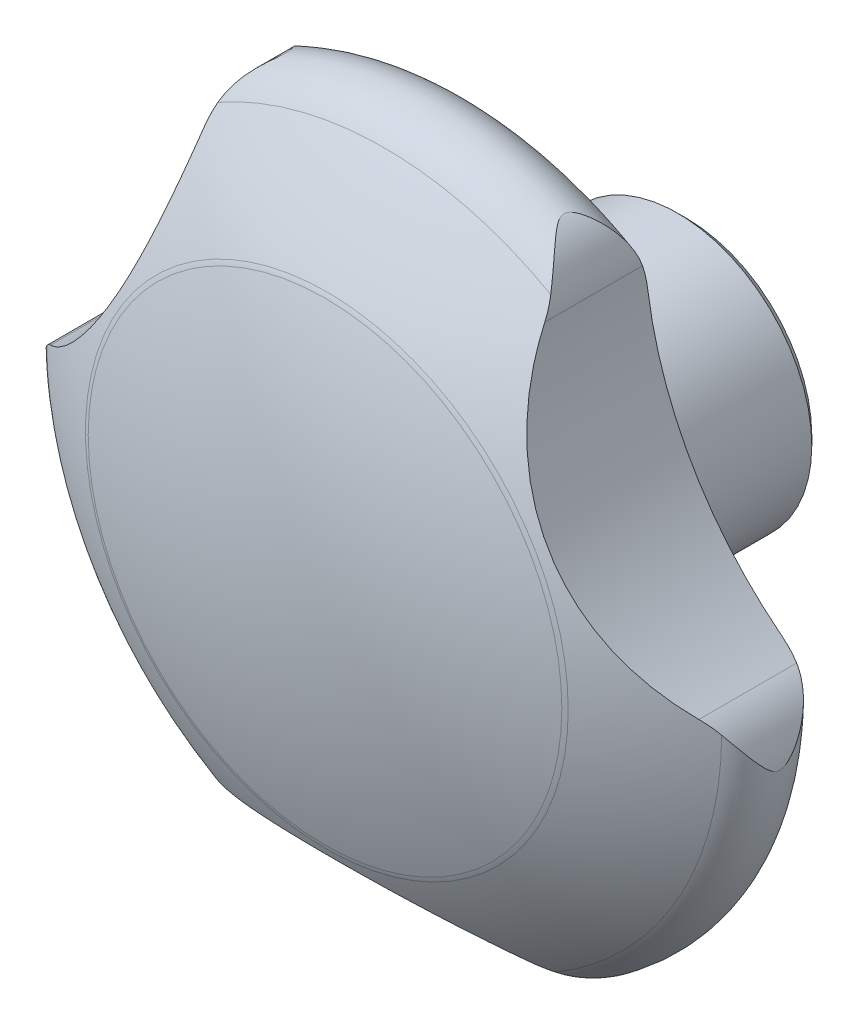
ISO-10303-21;
HEADER;
FILE_DESCRIPTION(('STEP AP214'),'2;1');
FILE_NAME('part.step','',(''),(''),'','','');
FILE_SCHEMA(('AUTOMOTIVE_DESIGN { 1 0 10303 214 1 1 1 1 }'));
ENDSEC;
DATA;
#1=APPLICATION_CONTEXT('core data for automotive mechanical design processes');
#2=APPLICATION_PROTOCOL_DEFINITION('international standard','automotive_design',2000,#1);
#3=PRODUCT_CONTEXT('',#1,'mechanical');
#4=PRODUCT('Part','Part','',(#3));
#5=PRODUCT_RELATED_PRODUCT_CATEGORY('part','',(#4));
#6=PRODUCT_DEFINITION_FORMATION('','',#4);
#7=PRODUCT_DEFINITION_CONTEXT('part definition',#1,'design');
#8=PRODUCT_DEFINITION('design','',#6,#7);
#9=PRODUCT_DEFINITION_SHAPE('','',#8);
#10=(LENGTH_UNIT() NAMED_UNIT(*) SI_UNIT(.MILLI.,.METRE.));
#11=(NAMED_UNIT(*) PLANE_ANGLE_UNIT() SI_UNIT($,.RADIAN.));
#12=(NAMED_UNIT(*) SI_UNIT($,.STERADIAN.) SOLID_ANGLE_UNIT());
#13=UNCERTAINTY_MEASURE_WITH_UNIT(LENGTH_MEASURE(1.E-05),#10,'distance_accuracy_value','');
#14=(GEOMETRIC_REPRESENTATION_CONTEXT(3) GLOBAL_UNCERTAINTY_ASSIGNED_CONTEXT((#13)) GLOBAL_UNIT_ASSIGNED_CONTEXT((#10,
#11,#12)) REPRESENTATION_CONTEXT('',''));
#15=CARTESIAN_POINT('',(0.,0.,0.));
#16=DIRECTION('',(0.,0.,1.));
#17=DIRECTION('',(1.,0.,0.));
#18=AXIS2_PLACEMENT_3D('',#15,#16,#17);
#19=CARTESIAN_POINT('',(0.,0.,22.25));
#20=DIRECTION('',(0.,0.,1.));
#21=DIRECTION('',(1.,0.,0.));
#22=AXIS2_PLACEMENT_3D('',#19,#20,#21);
#23=TOROIDAL_SURFACE('',#22,25.75,4.25);
#24=CARTESIAN_POINT('',(0.,0.,18.));
#25=DIRECTION('',(0.,0.,1.));
#26=DIRECTION('',(1.,0.,0.));
#27=AXIS2_PLACEMENT_3D('',#24,#25,#26);
#28=CIRCLE('',#27,25.75);
#29=CARTESIAN_POINT('',(11.2198622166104,-23.1770833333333,18.));
#30=VERTEX_POINT('',#29);
#31=CARTESIAN_POINT('',(25.6818740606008,1.87185596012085,18.));
#32=VERTEX_POINT('',#31);
#33=EDGE_CURVE('E372',#30,#32,#28,.T.);
#34=ORIENTED_EDGE('',*,*,#33,.T.);
#35=CARTESIAN_POINT('',(28.3586455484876,0.00320444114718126,25.6052149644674));
#36=CARTESIAN_POINT('',(28.2516925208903,0.0695044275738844,25.6883867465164));
#37=CARTESIAN_POINT('',(28.1418002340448,0.138584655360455,25.7654151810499));
#38=CARTESIAN_POINT('',(27.917649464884,0.281624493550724,25.9072450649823));
#39=CARTESIAN_POINT('',(27.8033970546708,0.35557741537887,25.9720628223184));
#40=CARTESIAN_POINT('',(27.5728544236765,0.507132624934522,26.0891894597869));
#41=CARTESIAN_POINT('',(27.4565942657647,0.58469309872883,26.1416123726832));
#42=CARTESIAN_POINT('',(27.2220769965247,0.743594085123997,26.2351405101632));
#43=CARTESIAN_POINT('',(27.1038191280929,0.824936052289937,26.276241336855));
#44=CARTESIAN_POINT('',(26.8503622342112,1.00202466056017,26.3523826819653));
#45=CARTESIAN_POINT('',(26.7150218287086,1.09823829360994,26.3858669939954));
#46=CARTESIAN_POINT('',(26.4442444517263,1.2941849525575,26.439718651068));
#47=CARTESIAN_POINT('',(26.3088074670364,1.39391981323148,26.4600790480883));
#48=CARTESIAN_POINT('',(25.9029090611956,1.69818625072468,26.5029042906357));
#49=CARTESIAN_POINT('',(25.6336969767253,1.90719632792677,26.5068760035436));
#50=CARTESIAN_POINT('',(25.1665412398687,2.28277908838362,26.4769466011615));
#51=CARTESIAN_POINT('',(24.9666600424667,2.4478392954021,26.4516891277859));
#52=CARTESIAN_POINT('',(24.5733706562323,2.78118653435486,26.3796707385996));
#53=CARTESIAN_POINT('',(24.3799662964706,2.94947538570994,26.3328973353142));
#54=CARTESIAN_POINT('',(24.000823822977,3.28788639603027,26.2205572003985));
#55=CARTESIAN_POINT('',(23.8150784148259,3.45800660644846,26.1550088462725));
#56=CARTESIAN_POINT('',(23.4515313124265,3.79932659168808,26.0073250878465));
#57=CARTESIAN_POINT('',(23.2737257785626,3.97052579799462,25.9251978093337));
#58=CARTESIAN_POINT('',(23.0436302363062,4.19748748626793,25.8065678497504));
#59=CARTESIAN_POINT('',(22.9876855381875,4.25311091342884,25.7767195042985));
#60=CARTESIAN_POINT('',(22.8766589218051,4.36436741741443,25.7154968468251));
#61=CARTESIAN_POINT('',(22.8215769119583,4.42000049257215,25.6841226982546));
#62=CARTESIAN_POINT('',(22.6228730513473,4.62225830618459,25.5673480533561));
#63=CARTESIAN_POINT('',(22.4818040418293,4.76886629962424,25.4775211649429));
#64=CARTESIAN_POINT('',(22.2057864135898,5.06149285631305,25.2880284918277));
#65=CARTESIAN_POINT('',(22.0708384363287,5.20751135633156,25.1883616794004));
#66=CARTESIAN_POINT('',(21.8074497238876,5.49810787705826,24.9793536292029));
#67=CARTESIAN_POINT('',(21.679001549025,5.64268738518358,24.8700238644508));
#68=CARTESIAN_POINT('',(21.4289742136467,5.92948922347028,24.6410588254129));
#69=CARTESIAN_POINT('',(21.3073919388,6.07171260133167,24.5214282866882));
#70=CARTESIAN_POINT('',(21.090555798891,6.33002794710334,24.2899398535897));
#71=CARTESIAN_POINT('',(20.9941694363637,6.44671035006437,24.1798209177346));
#72=CARTESIAN_POINT('',(20.8545182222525,6.61826513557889,24.0064049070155));
#73=CARTESIAN_POINT('',(20.8086697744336,6.67502344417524,23.9470516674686));
#74=CARTESIAN_POINT('',(20.7190244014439,6.78680408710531,23.8252533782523));
#75=CARTESIAN_POINT('',(20.6752270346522,6.841826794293,23.7628090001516));
#76=CARTESIAN_POINT('',(20.5893723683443,6.95043375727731,23.6331660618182));
#77=CARTESIAN_POINT('',(20.5473580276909,7.00397691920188,23.5659041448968));
#78=CARTESIAN_POINT('',(20.4665524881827,7.10763492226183,23.4267569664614));
#79=CARTESIAN_POINT('',(20.4277647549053,7.15774606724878,23.3548668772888));
#80=CARTESIAN_POINT('',(20.3549250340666,7.25241006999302,23.2062302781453));
#81=CARTESIAN_POINT('',(20.3208340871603,7.29700829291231,23.1295325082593));
#82=CARTESIAN_POINT('',(20.2588472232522,7.37850158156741,22.9699023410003));
#83=CARTESIAN_POINT('',(20.2309337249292,7.41541849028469,22.8869885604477));
#84=CARTESIAN_POINT('',(20.1889604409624,7.47112318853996,22.7329814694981));
#85=CARTESIAN_POINT('',(20.1732132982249,7.49210117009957,22.6631680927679));
#86=CARTESIAN_POINT('',(20.1487714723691,7.52471351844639,22.5202234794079));
#87=CARTESIAN_POINT('',(20.1400631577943,7.5363659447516,22.4470989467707));
#88=CARTESIAN_POINT('',(20.1308624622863,7.5486782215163,22.2988172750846));
#89=CARTESIAN_POINT('',(20.1304302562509,7.54925756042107,22.2236492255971));
#90=CARTESIAN_POINT('',(20.1380098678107,7.53911309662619,22.0744759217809));
#91=CARTESIAN_POINT('',(20.1460326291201,7.528374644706,22.0004723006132));
#92=CARTESIAN_POINT('',(20.1718648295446,7.49389425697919,21.8402662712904));
#93=CARTESIAN_POINT('',(20.1914073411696,7.46785323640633,21.7548612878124));
#94=CARTESIAN_POINT('',(20.2383689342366,7.4055816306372,21.5901708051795));
#95=CARTESIAN_POINT('',(20.2658081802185,7.36932496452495,21.5109016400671));
#96=CARTESIAN_POINT('',(20.3249722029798,7.29159781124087,21.361317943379));
#97=CARTESIAN_POINT('',(20.3564784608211,7.25039788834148,21.2907707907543));
#98=CARTESIAN_POINT('',(20.4232268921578,7.16363713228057,21.1542288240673));
#99=CARTESIAN_POINT('',(20.4584728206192,7.11807192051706,21.0882386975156));
#100=CARTESIAN_POINT('',(20.5318957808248,7.02375954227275,20.9599363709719));
#101=CARTESIAN_POINT('',(20.5700817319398,6.97500276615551,20.8976364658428));
#102=CARTESIAN_POINT('',(20.648687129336,6.87530966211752,20.7763532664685));
#103=CARTESIAN_POINT('',(20.6891056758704,6.82437421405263,20.7173686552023));
#104=CARTESIAN_POINT('',(20.7961257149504,6.69044218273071,20.5683122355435));
#105=CARTESIAN_POINT('',(20.864141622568,6.60621299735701,20.4803667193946));
#106=CARTESIAN_POINT('',(21.0039095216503,6.43511662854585,20.3101585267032));
#107=CARTESIAN_POINT('',(21.0756632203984,6.34824824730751,20.2278984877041));
#108=CARTESIAN_POINT('',(21.2224640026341,6.17261473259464,20.0681363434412));
#109=CARTESIAN_POINT('',(21.2975158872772,6.08384693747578,19.9906415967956));
#110=CARTESIAN_POINT('',(21.4504952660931,5.9050812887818,19.8400211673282));
#111=CARTESIAN_POINT('',(21.5284231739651,5.81508325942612,19.7668961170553));
#112=CARTESIAN_POINT('',(21.7666463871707,5.5433218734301,19.5531868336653));
#113=CARTESIAN_POINT('',(21.930982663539,5.3602695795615,19.4186954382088));
#114=CARTESIAN_POINT('',(22.2693804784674,4.9928373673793,19.1652640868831));
#115=CARTESIAN_POINT('',(22.4434333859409,4.8084587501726,19.0463106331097));
#116=CARTESIAN_POINT('',(22.8105978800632,4.4295305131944,18.8185239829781));
#117=CARTESIAN_POINT('',(23.0042306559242,4.23495965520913,18.7105610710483));
#118=CARTESIAN_POINT('',(23.4019464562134,3.84641859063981,18.5141156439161));
#119=CARTESIAN_POINT('',(23.6060336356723,3.65244865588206,18.4256409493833));
#120=CARTESIAN_POINT('',(24.0236567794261,3.26681798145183,18.2711050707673));
#121=CARTESIAN_POINT('',(24.2371671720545,3.07515259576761,18.2049869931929));
#122=CARTESIAN_POINT('',(24.6732364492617,2.69506258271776,18.0983250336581));
#123=CARTESIAN_POINT('',(24.8957901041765,2.50663616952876,18.057766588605));
#124=CARTESIAN_POINT('',(25.2895814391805,2.1830756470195,18.0130142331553));
#125=CARTESIAN_POINT('',(25.459131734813,2.04681269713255,18.0021108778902));
#126=CARTESIAN_POINT('',(25.8013436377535,1.77787663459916,17.998443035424));
#127=CARTESIAN_POINT('',(25.9740054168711,1.64520372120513,18.0056795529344));
#128=CARTESIAN_POINT('',(26.3200923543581,1.38519302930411,18.0401865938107));
#129=CARTESIAN_POINT('',(26.4935096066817,1.25783226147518,18.0673586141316));
#130=CARTESIAN_POINT('',(26.8397580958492,1.00914654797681,18.1434775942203));
#131=CARTESIAN_POINT('',(27.0125896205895,0.887818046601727,18.1924115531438));
#132=CARTESIAN_POINT('',(27.3928409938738,0.626688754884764,18.327169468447));
#133=CARTESIAN_POINT('',(27.5995408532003,0.488666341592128,18.4187275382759));
#134=CARTESIAN_POINT('',(27.9019772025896,0.291783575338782,18.5841459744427));
#135=CARTESIAN_POINT('',(28.0019140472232,0.227605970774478,18.6442705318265));
#136=CARTESIAN_POINT('',(28.1981542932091,0.103148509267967,18.7740483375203));
#137=CARTESIAN_POINT('',(28.2944534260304,0.0428731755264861,18.8437123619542));
#138=CARTESIAN_POINT('',(28.3884330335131,-0.0152404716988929,18.9181612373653));
#139=B_SPLINE_CURVE_WITH_KNOTS('',3,(#35,#36,#37,#38,#39,#40,#41,#42,#43,#44,#45,#46,#47,#48,
#49,#50,#51,#52,#53,#54,#55,#56,#57,#58,#59,#60,#61,#62,#63,#64,#65,#66,#67,#68,#69,#70,#71,#72,
#73,#74,#75,#76,#77,#78,#79,#80,#81,#82,#83,#84,#85,#86,#87,#88,#89,#90,#91,#92,#93,#94,#95,#96,
#97,#98,#99,#100,#101,#102,#103,#104,#105,#106,#107,#108,#109,#110,#111,#112,#113,#114,#115,
#116,#117,#118,#119,#120,#121,#122,#123,#124,#125,#126,#127,#128,#129,#130,#131,#132,#133,#134,
#135,#136,#137,#138),.UNSPECIFIED.,.F.,.F.,(4,2,2,2,2,2,2,2,2,2,2,2,2,2,2,2,2,2,2,2,2,2,2,2,2,2,
2,2,2,2,2,2,2,2,2,2,2,2,2,2,2,2,2,2,2,2,2,2,2,2,2,4),(0.,0.452219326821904,0.903830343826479,
1.35110905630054,1.79856126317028,2.30613226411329,2.8139717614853,3.83275990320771,
4.61318343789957,5.39406048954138,6.17417579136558,6.95390966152,7.20694459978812,
7.45995249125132,8.12681848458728,8.79375420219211,9.45990842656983,10.1257580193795,
10.6868350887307,10.9689321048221,11.2509681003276,11.5378614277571,11.8250590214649,
12.1097088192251,12.3935377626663,12.6164789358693,12.8389873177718,13.0631129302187,
13.287528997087,13.5601870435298,13.8335476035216,14.0958392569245,14.3583968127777,
14.6217849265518,14.8850676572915,15.303243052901,15.7216111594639,16.1406098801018,
16.5596691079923,17.4000471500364,18.2396902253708,19.1238259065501,20.0083157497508,
20.8905374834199,21.7722560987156,22.4249345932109,23.0776492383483,23.7271603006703,
24.3762838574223,25.167654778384,25.5666234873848,25.9660466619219),.UNSPECIFIED.);
#140=CARTESIAN_POINT('',(27.1837405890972,0.770283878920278,18.2530660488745));
#141=VERTEX_POINT('',#140);
#142=EDGE_CURVE('E190',#32,#141,#139,.T.);
#143=ORIENTED_EDGE('',*,*,#142,.T.);
#144=CARTESIAN_POINT('',(28.2964873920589,-0.217782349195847,25.6520042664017));
#145=CARTESIAN_POINT('',(28.4017556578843,-0.337720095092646,25.5724558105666));
#146=CARTESIAN_POINT('',(28.5009544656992,-0.460394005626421,25.4891888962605));
#147=CARTESIAN_POINT('',(28.6874204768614,-0.71005201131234,25.3160467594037));
#148=CARTESIAN_POINT('',(28.7746893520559,-0.837035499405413,25.2261724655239));
#149=CARTESIAN_POINT('',(28.939213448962,-1.09683967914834,25.0387057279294));
#150=CARTESIAN_POINT('',(29.0162246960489,-1.22972675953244,24.9409922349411));
#151=CARTESIAN_POINT('',(29.1583237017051,-1.49756950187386,24.740068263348));
#152=CARTESIAN_POINT('',(29.2234169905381,-1.63252417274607,24.6368603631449));
#153=CARTESIAN_POINT('',(29.3475642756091,-1.91588975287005,24.4151899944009));
#154=CARTESIAN_POINT('',(29.4054906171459,-2.06438293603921,24.2962021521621));
#155=CARTESIAN_POINT('',(29.5080814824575,-2.36068481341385,24.0509799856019));
#156=CARTESIAN_POINT('',(29.5527123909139,-2.50849085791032,23.9247282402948));
#157=CARTESIAN_POINT('',(29.6096621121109,-2.72566652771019,23.729489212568));
#158=CARTESIAN_POINT('',(29.6268949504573,-2.79683278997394,23.6638991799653));
#159=CARTESIAN_POINT('',(29.6582713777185,-2.93724129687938,23.529989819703));
#160=CARTESIAN_POINT('',(29.6724158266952,-3.00648407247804,23.4616712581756));
#161=CARTESIAN_POINT('',(29.6976441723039,-3.14157233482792,23.3217828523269));
#162=CARTESIAN_POINT('',(29.708741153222,-3.20743132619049,23.2502284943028));
#163=CARTESIAN_POINT('',(29.7280392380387,-3.3339576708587,23.1023561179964));
#164=CARTESIAN_POINT('',(29.7362449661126,-3.39463319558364,23.0260459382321));
#165=CARTESIAN_POINT('',(29.7475571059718,-3.48754208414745,22.8939042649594));
#166=CARTESIAN_POINT('',(29.7514474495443,-3.52239924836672,22.8400105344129));
#167=CARTESIAN_POINT('',(29.7580672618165,-3.58597889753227,22.728625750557));
#168=CARTESIAN_POINT('',(29.7607983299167,-3.61470980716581,22.6711397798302));
#169=CARTESIAN_POINT('',(29.7647774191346,-3.65898907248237,22.5619698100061));
#170=CARTESIAN_POINT('',(29.7661948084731,-3.67592407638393,22.5108716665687));
#171=CARTESIAN_POINT('',(29.768244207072,-3.70106711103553,22.4065499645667));
#172=CARTESIAN_POINT('',(29.7688776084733,-3.70929060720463,22.3533303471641));
#173=CARTESIAN_POINT('',(29.7693634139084,-3.71555476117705,22.2459140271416));
#174=CARTESIAN_POINT('',(29.7692108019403,-3.71353002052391,22.1917132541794));
#175=CARTESIAN_POINT('',(29.768113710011,-3.69955495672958,22.0846268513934));
#176=CARTESIAN_POINT('',(29.7671682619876,-3.68759249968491,22.0317429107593));
#177=CARTESIAN_POINT('',(29.7639777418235,-3.64977293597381,21.9091740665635));
#178=CARTESIAN_POINT('',(29.7613782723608,-3.62038762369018,21.8406252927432));
#179=CARTESIAN_POINT('',(29.7546364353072,-3.55207647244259,21.7084865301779));
#180=CARTESIAN_POINT('',(29.7504875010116,-3.51311027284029,21.6449190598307));
#181=CARTESIAN_POINT('',(29.7379432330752,-3.40704448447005,21.4890217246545));
#182=CARTESIAN_POINT('',(29.7284635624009,-3.33604366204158,21.3994899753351));
#183=CARTESIAN_POINT('',(29.705531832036,-3.18718496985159,21.2267719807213));
#184=CARTESIAN_POINT('',(29.6920700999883,-3.10931073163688,21.1436018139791));
#185=CARTESIAN_POINT('',(29.6609396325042,-2.94934051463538,20.9813292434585));
#186=CARTESIAN_POINT('',(29.6432474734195,-2.86722309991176,20.9022525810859));
#187=CARTESIAN_POINT('',(29.6035974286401,-2.70091874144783,20.7476284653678));
#188=CARTESIAN_POINT('',(29.5816437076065,-2.61673388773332,20.6720776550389));
#189=CARTESIAN_POINT('',(29.5118027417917,-2.37157397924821,20.4575335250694));
#190=CARTESIAN_POINT('',(29.4582510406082,-2.20908748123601,20.3220650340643));
#191=CARTESIAN_POINT('',(29.3347943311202,-1.88378678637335,20.058981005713));
#192=CARTESIAN_POINT('',(29.2648766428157,-1.72097243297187,19.9313716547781));
#193=CARTESIAN_POINT('',(29.1086142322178,-1.39849418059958,19.684657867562));
#194=CARTESIAN_POINT('',(29.022368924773,-1.23881735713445,19.565507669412));
#195=CARTESIAN_POINT('',(28.8326945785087,-0.923725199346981,19.3355623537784));
#196=CARTESIAN_POINT('',(28.7292703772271,-0.768308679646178,19.2247648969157));
#197=CARTESIAN_POINT('',(28.5231862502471,-0.488675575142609,19.0301537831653));
#198=CARTESIAN_POINT('',(28.4231728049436,-0.363516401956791,18.9448920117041));
#199=CARTESIAN_POINT('',(28.2107060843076,-0.118897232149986,18.7822070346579));
#200=CARTESIAN_POINT('',(28.098260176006,0.000566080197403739,18.7047792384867));
#201=CARTESIAN_POINT('',(27.8596275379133,0.233650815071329,18.5583105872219));
#202=CARTESIAN_POINT('',(27.7333138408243,0.347201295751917,18.4893620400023));
#203=CARTESIAN_POINT('',(27.4679083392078,0.565733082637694,18.3624343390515));
#204=CARTESIAN_POINT('',(27.3287910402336,0.670696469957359,18.3044778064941));
#205=CARTESIAN_POINT('',(27.1835405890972,0.770421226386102,18.2529952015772));
#206=B_SPLINE_CURVE_WITH_KNOTS('',3,(#144,#145,#146,#147,#148,#149,#150,#151,#152,#153,#154,
#155,#156,#157,#158,#159,#160,#161,#162,#163,#164,#165,#166,#167,#168,#169,#170,#171,#172,#173,
#174,#175,#176,#177,#178,#179,#180,#181,#182,#183,#184,#185,#186,#187,#188,#189,#190,#191,#192,
#193,#194,#195,#196,#197,#198,#199,#200,#201,#202,#203,#204,#205),.UNSPECIFIED.,.F.,.F.,(4,2,2,
2,2,2,2,2,2,2,2,2,2,2,2,2,2,2,2,2,2,2,2,2,2,2,2,2,2,2,4),(0.,0.534644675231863,1.06921434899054,
1.61482207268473,2.16017597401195,2.75633815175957,3.35399507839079,3.6488305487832,
3.94358380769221,4.23705102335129,4.53004672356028,4.72269091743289,4.91506845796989,
5.07602562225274,5.23669656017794,5.39839409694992,5.56028935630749,5.7828931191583,
6.00645119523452,6.34956383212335,6.69351682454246,7.03942026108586,7.38498734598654,
8.03881231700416,8.69314554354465,9.34361587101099,9.99390333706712,10.5377375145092,
11.0812511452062,11.6302379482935,12.1803425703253),.UNSPECIFIED.);
#207=CARTESIAN_POINT('',(28.2967521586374,-0.21808403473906,25.6518042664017));
#208=VERTEX_POINT('',#207);
#209=EDGE_CURVE('E184',#208,#141,#206,.T.);
#210=ORIENTED_EDGE('',*,*,#209,.F.);
#211=CARTESIAN_POINT('',(0.,0.,25.6518042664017));
#212=DIRECTION('',(0.,0.,1.));
#213=DIRECTION('',(1.,0.,0.));
#214=AXIS2_PLACEMENT_3D('',#211,#212,#213);
#215=CIRCLE('',#214,28.2975925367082);
#216=CARTESIAN_POINT('',(14.3372423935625,-24.3966641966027,25.6518042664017));
#217=VERTEX_POINT('',#216);
#218=EDGE_CURVE('E375',#217,#208,#215,.T.);
#219=ORIENTED_EDGE('',*,*,#218,.F.);
#220=CARTESIAN_POINT('',(12.924584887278,-23.9268563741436,18.2530013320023));
#221=CARTESIAN_POINT('',(13.08276589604,-24.0023976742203,18.3042220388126));
#222=CARTESIAN_POINT('',(13.2424032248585,-24.0700892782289,18.3618521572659));
#223=CARTESIAN_POINT('',(13.5627184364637,-24.1902150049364,18.4880268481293));
#224=CARTESIAN_POINT('',(13.7233936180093,-24.24267920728,18.5565494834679));
#225=CARTESIAN_POINT('',(14.0437217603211,-24.3328537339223,18.7024437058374));
#226=CARTESIAN_POINT('',(14.2033757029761,-24.3706391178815,18.7797675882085));
#227=CARTESIAN_POINT('',(14.5214120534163,-24.4326008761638,18.9422532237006));
#228=CARTESIAN_POINT('',(14.6797936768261,-24.4567694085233,19.0274194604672));
#229=CARTESIAN_POINT('',(15.0162830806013,-24.4947372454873,19.2169298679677));
#230=CARTESIAN_POINT('',(15.1940368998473,-24.5066032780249,19.3222875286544));
#231=CARTESIAN_POINT('',(15.5451457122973,-24.5148070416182,19.5406380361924));
#232=CARTESIAN_POINT('',(15.7185000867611,-24.5111426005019,19.6536319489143));
#233=CARTESIAN_POINT('',(16.0594156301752,-24.4895504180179,19.8865931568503));
#234=CARTESIAN_POINT('',(16.2269789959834,-24.4716281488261,20.006557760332));
#235=CARTESIAN_POINT('',(16.5548027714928,-24.4229470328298,20.2534912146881));
#236=CARTESIAN_POINT('',(16.7150668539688,-24.3921947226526,20.3804564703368));
#237=CARTESIAN_POINT('',(16.9762277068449,-24.3313800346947,20.6006819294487));
#238=CARTESIAN_POINT('',(17.0796984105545,-24.3042514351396,20.6917126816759));
#239=CARTESIAN_POINT('',(17.2810998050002,-24.2458665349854,20.8787922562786));
#240=CARTESIAN_POINT('',(17.3790215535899,-24.2146038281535,20.9748487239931));
#241=CARTESIAN_POINT('',(17.567664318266,-24.1492641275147,21.1746262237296));
#242=CARTESIAN_POINT('',(17.6583241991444,-24.1151673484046,21.2784004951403));
#243=CARTESIAN_POINT('',(17.7837928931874,-24.0648870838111,21.4422579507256));
#244=CARTESIAN_POINT('',(17.8238236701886,-24.0482890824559,21.4981765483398));
#245=CARTESIAN_POINT('',(17.8988700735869,-24.0163145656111,21.6135699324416));
#246=CARTESIAN_POINT('',(17.9338937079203,-24.0009361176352,21.6730388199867));
#247=CARTESIAN_POINT('',(17.9928195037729,-23.974506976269,21.7890600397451));
#248=CARTESIAN_POINT('',(18.0175507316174,-23.9631586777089,21.8451108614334));
#249=CARTESIAN_POINT('',(18.058633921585,-23.9440703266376,21.9607213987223));
#250=CARTESIAN_POINT('',(18.075018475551,-23.9363162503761,22.0202664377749));
#251=CARTESIAN_POINT('',(18.094471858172,-23.9270690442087,22.1296611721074));
#252=CARTESIAN_POINT('',(18.0995520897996,-23.9246321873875,22.1790605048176));
#253=CARTESIAN_POINT('',(18.1018003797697,-23.9235561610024,22.2781056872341));
#254=CARTESIAN_POINT('',(18.0989668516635,-23.9249177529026,22.327751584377));
#255=CARTESIAN_POINT('',(18.0858826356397,-23.9311561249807,22.425513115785));
#256=CARTESIAN_POINT('',(18.0756699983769,-23.9360148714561,22.4736352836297));
#257=CARTESIAN_POINT('',(18.049196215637,-23.9484610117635,22.5677863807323));
#258=CARTESIAN_POINT('',(18.0329297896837,-23.9560507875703,22.6138134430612));
#259=CARTESIAN_POINT('',(17.9769122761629,-23.9817775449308,22.749401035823));
#260=CARTESIAN_POINT('',(17.9301377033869,-24.0027725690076,22.8354413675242));
#261=CARTESIAN_POINT('',(17.8261408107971,-24.0474629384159,23.0003762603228));
#262=CARTESIAN_POINT('',(17.7688572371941,-24.0711737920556,23.0792246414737));
#263=CARTESIAN_POINT('',(17.6567692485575,-24.1153202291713,23.2204718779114));
#264=CARTESIAN_POINT('',(17.6028411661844,-24.1357241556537,23.2835836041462));
#265=CARTESIAN_POINT('',(17.4915508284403,-24.1759050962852,23.4069300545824));
#266=CARTESIAN_POINT('',(17.4341870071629,-24.1956818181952,23.4671634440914));
#267=CARTESIAN_POINT('',(17.2579837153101,-24.2533254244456,23.6447132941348));
#268=CARTESIAN_POINT('',(17.1351944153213,-24.2894404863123,23.758686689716));
#269=CARTESIAN_POINT('',(16.8822081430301,-24.3547311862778,23.9805991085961));
#270=CARTESIAN_POINT('',(16.75199841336,-24.3838943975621,24.088527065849));
#271=CARTESIAN_POINT('',(16.4860377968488,-24.4339247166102,24.299138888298));
#272=CARTESIAN_POINT('',(16.3502914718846,-24.4547985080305,24.4018269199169));
#273=CARTESIAN_POINT('',(16.063619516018,-24.4885976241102,24.6101157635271));
#274=CARTESIAN_POINT('',(15.9123287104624,-24.5007895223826,24.715334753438));
#275=CARTESIAN_POINT('',(15.6054467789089,-24.5135448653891,24.9200989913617));
#276=CARTESIAN_POINT('',(15.4498552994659,-24.5141073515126,25.019643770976));
#277=CARTESIAN_POINT('',(15.136034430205,-24.5027410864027,25.2121034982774));
#278=CARTESIAN_POINT('',(14.9778207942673,-24.49087078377,25.3050472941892));
#279=CARTESIAN_POINT('',(14.6589247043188,-24.4538822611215,25.4839809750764));
#280=CARTESIAN_POINT('',(14.4982409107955,-24.4287565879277,25.5699669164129));
#281=CARTESIAN_POINT('',(14.3368487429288,-24.3965857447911,25.6520042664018));
#282=B_SPLINE_CURVE_WITH_KNOTS('',3,(#220,#221,#222,#223,#224,#225,#226,#227,#228,#229,#230,
#231,#232,#233,#234,#235,#236,#237,#238,#239,#240,#241,#242,#243,#244,#245,#246,#247,#248,#249,
#250,#251,#252,#253,#254,#255,#256,#257,#258,#259,#260,#261,#262,#263,#264,#265,#266,#267,#268,
#269,#270,#271,#272,#273,#274,#275,#276,#277,#278,#279,#280,#281),.UNSPECIFIED.,.F.,.F.,(4,2,2,
2,2,2,2,2,2,2,2,2,2,2,2,2,2,2,2,2,2,2,2,2,2,2,2,2,2,2,4),(0.,0.547312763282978,1.09353691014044,
1.63692998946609,2.18063569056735,2.80070994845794,3.42087093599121,4.04079401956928,
4.66040165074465,5.08155483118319,5.50336845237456,5.92842440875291,6.14048239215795,
6.35219734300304,6.53859721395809,6.72426354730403,6.87269653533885,7.02115928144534,
7.16886188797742,7.31669363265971,7.61542458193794,7.91595550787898,8.17224716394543,
8.42865653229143,8.94225275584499,9.45676028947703,9.97085213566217,10.5244200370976,
11.078033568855,11.6290561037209,12.180388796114),.UNSPECIFIED.);
#283=CARTESIAN_POINT('',(12.924784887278,-23.9269518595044,18.2530660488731));
#284=VERTEX_POINT('',#283);
#285=EDGE_CURVE('E178',#284,#217,#282,.T.);
#286=ORIENTED_EDGE('',*,*,#285,.F.);
#287=CARTESIAN_POINT('',(12.924984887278,-23.9270473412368,18.2531307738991));
#288=CARTESIAN_POINT('',(12.7672690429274,-23.8517302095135,18.2020778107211));
#289=CARTESIAN_POINT('',(12.6068056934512,-23.7768358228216,18.1593603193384));
#290=CARTESIAN_POINT('',(12.2820392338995,-23.6287926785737,18.089570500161));
#291=CARTESIAN_POINT('',(12.11774296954,-23.5556412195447,18.0624722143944));
#292=CARTESIAN_POINT('',(11.7886938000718,-23.4127107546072,18.0230035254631));
#293=CARTESIAN_POINT('',(11.6239777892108,-23.3428993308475,18.0104369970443));
#294=CARTESIAN_POINT('',(11.2928530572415,-23.2060514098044,17.9982572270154));
#295=CARTESIAN_POINT('',(11.1264434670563,-23.139016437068,17.9986510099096));
#296=CARTESIAN_POINT('',(10.7217665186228,-22.9802040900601,18.0140274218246));
#297=CARTESIAN_POINT('',(10.4830864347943,-22.8900513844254,18.0351533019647));
#298=CARTESIAN_POINT('',(10.0060375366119,-22.7167238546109,18.0986373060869));
#299=CARTESIAN_POINT('',(9.76766885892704,-22.6335514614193,18.1410027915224));
#300=CARTESIAN_POINT('',(9.2903491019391,-22.4736374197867,18.2448702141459));
#301=CARTESIAN_POINT('',(9.05141425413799,-22.3969648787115,18.3065512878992));
#302=CARTESIAN_POINT('',(8.57636352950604,-22.2509518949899,18.4466585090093));
#303=CARTESIAN_POINT('',(8.34024702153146,-22.1816097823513,18.5250808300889));
#304=CARTESIAN_POINT('',(7.79541088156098,-22.028713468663,18.7247959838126));
#305=CARTESIAN_POINT('',(7.4879903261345,-21.9478475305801,18.8517428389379));
#306=CARTESIAN_POINT('',(7.03266325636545,-21.8355322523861,19.059926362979));
#307=CARTESIAN_POINT('',(6.88173936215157,-21.7995665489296,19.1323448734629));
#308=CARTESIAN_POINT('',(6.58213009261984,-21.7305760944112,19.2829896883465));
#309=CARTESIAN_POINT('',(6.43344456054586,-21.6975511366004,19.3612155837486));
#310=CARTESIAN_POINT('',(6.13966927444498,-21.6345972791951,19.5229439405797));
#311=CARTESIAN_POINT('',(5.99456194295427,-21.604648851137,19.6064068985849));
#312=CARTESIAN_POINT('',(5.70740797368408,-21.5475483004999,19.7793348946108));
#313=CARTESIAN_POINT('',(5.5653610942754,-21.5203959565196,19.8687994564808));
#314=CARTESIAN_POINT('',(5.28537592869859,-21.4689142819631,20.0541421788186));
#315=CARTESIAN_POINT('',(5.1474303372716,-21.4445796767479,20.1500078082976));
#316=CARTESIAN_POINT('',(4.87670431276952,-21.3987070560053,20.3493425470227));
#317=CARTESIAN_POINT('',(4.74392084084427,-21.3771673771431,20.4528070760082));
#318=CARTESIAN_POINT('',(4.55989706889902,-21.3485167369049,20.6072416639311));
#319=CARTESIAN_POINT('',(4.50555119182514,-21.3402134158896,20.6543000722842));
#320=CARTESIAN_POINT('',(4.39854911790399,-21.3241564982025,20.7504063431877));
#321=CARTESIAN_POINT('',(4.34589303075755,-21.3164029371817,20.7994543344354));
#322=CARTESIAN_POINT('',(4.24263984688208,-21.3014692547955,20.8998505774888));
#323=CARTESIAN_POINT('',(4.19204441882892,-21.2942895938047,20.9512006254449));
#324=CARTESIAN_POINT('',(4.09355777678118,-21.2805575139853,21.05650037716));
#325=CARTESIAN_POINT('',(4.04566610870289,-21.2740049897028,21.1104496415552));
#326=CARTESIAN_POINT('',(3.92703897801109,-21.2580485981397,21.2529656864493));
#327=CARTESIAN_POINT('',(3.85883192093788,-21.2491468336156,21.3437453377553));
#328=CARTESIAN_POINT('',(3.73605042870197,-21.2334795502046,21.5343265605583));
#329=CARTESIAN_POINT('',(3.68143468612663,-21.2267075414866,21.6340995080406));
#330=CARTESIAN_POINT('',(3.60973904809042,-21.217948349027,21.8052984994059));
#331=CARTESIAN_POINT('',(3.58622720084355,-21.2151164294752,21.8739345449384));
#332=CARTESIAN_POINT('',(3.55062020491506,-21.2108505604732,22.0141353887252));
#333=CARTESIAN_POINT('',(3.53850525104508,-21.209414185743,22.0856948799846));
#334=CARTESIAN_POINT('',(3.52735901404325,-21.2080920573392,22.2303167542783));
#335=CARTESIAN_POINT('',(3.52840650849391,-21.20821564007,22.3033855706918));
#336=CARTESIAN_POINT('',(3.54360528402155,-21.2100199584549,22.4481129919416));
#337=CARTESIAN_POINT('',(3.55776617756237,-21.2117018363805,22.519770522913));
#338=CARTESIAN_POINT('',(3.60261000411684,-21.2170883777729,22.6789952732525));
#339=CARTESIAN_POINT('',(3.63675456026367,-21.2212207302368,22.7655480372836));
#340=CARTESIAN_POINT('',(3.71789399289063,-21.2312424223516,22.9323234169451));
#341=CARTESIAN_POINT('',(3.7649299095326,-21.2371373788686,23.0125247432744));
#342=CARTESIAN_POINT('',(3.87724833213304,-21.2515426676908,23.1814030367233));
#343=CARTESIAN_POINT('',(3.94429830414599,-21.2603360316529,23.2688552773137));
#344=CARTESIAN_POINT('',(4.0862889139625,-21.2795120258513,23.4369990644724));
#345=CARTESIAN_POINT('',(4.16124357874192,-21.2898974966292,23.5176781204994));
#346=CARTESIAN_POINT('',(4.31724422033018,-21.3121627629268,23.674312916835));
#347=CARTESIAN_POINT('',(4.39834501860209,-21.3240568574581,23.750211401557));
#348=CARTESIAN_POINT('',(4.56433061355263,-21.3491326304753,23.8973493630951));
#349=CARTESIAN_POINT('',(4.64921255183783,-21.3623133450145,23.9685922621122));
#350=CARTESIAN_POINT('',(4.84405974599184,-21.3934609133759,24.1250579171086));
#351=CARTESIAN_POINT('',(4.9548615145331,-21.4117868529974,24.2091636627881));
#352=CARTESIAN_POINT('',(5.17985331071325,-21.4503440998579,24.3722816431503));
#353=CARTESIAN_POINT('',(5.29404428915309,-21.4705759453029,24.4512924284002));
#354=CARTESIAN_POINT('',(5.52525580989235,-21.5129624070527,24.6049172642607));
#355=CARTESIAN_POINT('',(5.64228053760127,-21.5351200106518,24.6795241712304));
#356=CARTESIAN_POINT('',(5.87851786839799,-21.5813406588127,24.8245691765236));
#357=CARTESIAN_POINT('',(5.99773055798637,-21.6054037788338,24.8950071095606));
#358=CARTESIAN_POINT('',(6.23104037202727,-21.6540036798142,25.0279268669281));
#359=CARTESIAN_POINT('',(6.3450324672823,-21.6784317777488,25.0906331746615));
#360=CARTESIAN_POINT('',(6.57447905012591,-21.7290241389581,25.2125770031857));
#361=CARTESIAN_POINT('',(6.68993355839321,-21.7551884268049,25.2718144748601));
#362=CARTESIAN_POINT('',(6.92172288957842,-21.8091819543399,25.3865990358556));
#363=CARTESIAN_POINT('',(7.03805285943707,-21.8370046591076,25.4421589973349));
#364=CARTESIAN_POINT('',(7.27189439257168,-21.8944325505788,25.5497483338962));
#365=CARTESIAN_POINT('',(7.38940591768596,-21.9240376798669,25.6017778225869));
#366=CARTESIAN_POINT('',(7.507452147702,-21.9545500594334,25.6520042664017));
#367=B_SPLINE_CURVE_WITH_KNOTS('',3,(#287,#288,#289,#290,#291,#292,#293,#294,#295,#296,#297,
#298,#299,#300,#301,#302,#303,#304,#305,#306,#307,#308,#309,#310,#311,#312,#313,#314,#315,#316,
#317,#318,#319,#320,#321,#322,#323,#324,#325,#326,#327,#328,#329,#330,#331,#332,#333,#334,#335,
#336,#337,#338,#339,#340,#341,#342,#343,#344,#345,#346,#347,#348,#349,#350,#351,#352,#353,#354,
#355,#356,#357,#358,#359,#360,#361,#362,#363,#364,#365,#366),.UNSPECIFIED.,.F.,.F.,(4,2,2,2,2,2,
2,2,2,2,2,2,2,2,2,2,2,2,2,2,2,2,2,2,2,2,2,2,2,2,2,2,2,2,2,2,2,2,2,4),(0.,0.545839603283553,
1.09076942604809,1.6282555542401,2.16603300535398,2.93289855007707,3.7000300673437,
4.47449804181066,5.24878919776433,6.27429618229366,6.78785178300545,7.30137124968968,
7.81139832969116,8.32138499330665,8.83040100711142,9.33911268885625,9.55617423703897,
9.77324984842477,9.9904978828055,10.2077093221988,10.5486584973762,10.8885584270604,
11.105593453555,11.3222506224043,11.5402051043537,11.7583194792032,12.0361406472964,
12.3148567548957,12.6457589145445,12.9772584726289,13.3121748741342,13.6468422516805,
14.0675828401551,14.4884425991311,14.9099672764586,15.3315086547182,15.7285667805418,
16.1256305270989,16.5212216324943,16.9168000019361),.UNSPECIFIED.);
#368=EDGE_CURVE('E138',#284,#30,#367,.T.);
#369=ORIENTED_EDGE('',*,*,#368,.T.);
#370=EDGE_LOOP('',(#34,#143,#210,#219,#286,#369));
#371=FACE_BOUND('',#370,.T.);
#372=ADVANCED_FACE('F14',(#371),#23,.T.);
#373=CARTESIAN_POINT('',(-27.1835405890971,0.770421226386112,18.2529952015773));
#374=CARTESIAN_POINT('',(-27.3280522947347,0.671203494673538,18.3042154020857));
#375=CARTESIAN_POINT('',(-27.4664941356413,0.566799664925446,18.3618450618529));
#376=CARTESIAN_POINT('',(-27.7306847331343,0.34946204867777,18.4880189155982));
#377=CARTESIAN_POINT('',(-27.8564581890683,0.236545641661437,18.556541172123));
#378=CARTESIAN_POINT('',(-28.0947167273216,0.00422111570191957,18.7024346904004));
#379=CARTESIAN_POINT('',(-28.207267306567,-0.115150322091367,18.7797582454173));
#380=CARTESIAN_POINT('',(-28.4199469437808,-0.359596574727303,18.9422432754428));
#381=CARTESIAN_POINT('',(-28.5200688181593,-0.484674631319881,19.027409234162));
#382=CARTESIAN_POINT('',(-28.7211954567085,-0.757098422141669,19.2169188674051));
#383=CARTESIAN_POINT('',(-28.8203490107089,-0.905104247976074,19.3222760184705));
#384=CARTESIAN_POINT('',(-29.0030088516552,-1.20507060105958,19.5406255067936));
#385=CARTESIAN_POINT('',(-29.0865129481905,-1.35703167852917,19.6536189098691));
#386=CARTESIAN_POINT('',(-29.2382722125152,-1.66306850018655,19.8865790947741));
#387=CARTESIAN_POINT('',(-29.3065332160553,-1.81714341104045,20.0065431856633));
#388=CARTESIAN_POINT('',(-29.4282869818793,-2.12538706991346,20.2534755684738));
#389=CARTESIAN_POINT('',(-29.4817872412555,-2.27955573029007,20.380440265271));
#390=CARTESIAN_POINT('',(-29.5597017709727,-2.53613570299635,20.6006655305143));
#391=CARTESIAN_POINT('',(-29.5879436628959,-2.6393091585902,20.6916967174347));
#392=CARTESIAN_POINT('',(-29.638082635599,-2.84292218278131,20.8787771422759));
#393=CARTESIAN_POINT('',(-29.6599696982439,-2.94335721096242,20.9748340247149));
#394=CARTESIAN_POINT('',(-29.6977061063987,-3.13939847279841,21.1746122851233));
#395=CARTESIAN_POINT('',(-29.7135077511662,-3.23496165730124,21.278386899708));
#396=CARTESIAN_POINT('',(-29.7326986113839,-3.36876261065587,21.4422448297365));
#397=CARTESIAN_POINT('',(-29.7383398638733,-3.41172989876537,21.4981635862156));
#398=CARTESIAN_POINT('',(-29.7481726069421,-3.49271057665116,21.6135572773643));
#399=CARTESIAN_POINT('',(-29.7523664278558,-3.53073186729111,21.6730263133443));
#400=CARTESIAN_POINT('',(-29.7589412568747,-3.59497928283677,21.7890481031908));
#401=CARTESIAN_POINT('',(-29.7614790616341,-3.62207215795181,21.8450993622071));
#402=CARTESIAN_POINT('',(-29.7654898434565,-3.66719712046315,21.9607108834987));
#403=CARTESIAN_POINT('',(-29.7669669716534,-3.68526444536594,22.0202564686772));
#404=CARTESIAN_POINT('',(-29.7686854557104,-3.70673644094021,22.1296517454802));
#405=CARTESIAN_POINT('',(-29.7691152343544,-3.71235502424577,22.1790510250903));
#406=CARTESIAN_POINT('',(-29.7693075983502,-3.71484121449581,22.2780961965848));
#407=CARTESIAN_POINT('',(-29.7690700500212,-3.71170706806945,22.3277421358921));
#408=CARTESIAN_POINT('',(-29.7679306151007,-3.69725764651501,22.4255038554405));
#409=CARTESIAN_POINT('',(-29.7670321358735,-3.68598433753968,22.4736261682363));
#410=CARTESIAN_POINT('',(-29.7645740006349,-3.65683511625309,22.5677775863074));
#411=CARTESIAN_POINT('',(-29.7630137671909,-3.63895343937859,22.6138048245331));
#412=CARTESIAN_POINT('',(-29.7572852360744,-3.57757918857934,22.7493911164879));
#413=CARTESIAN_POINT('',(-29.7520803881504,-3.52657531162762,22.8354301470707));
#414=CARTESIAN_POINT('',(-29.7387854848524,-3.41416944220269,23.0003625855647));
#415=CARTESIAN_POINT('',(-29.7306782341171,-3.35270664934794,23.0792098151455));
#416=CARTESIAN_POINT('',(-29.7128669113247,-3.23356545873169,23.2204549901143));
#417=CARTESIAN_POINT('',(-29.7035735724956,-3.17666181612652,23.2835657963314));
#418=CARTESIAN_POINT('',(-29.6827269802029,-3.06019388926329,23.4069104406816));
#419=CARTESIAN_POINT('',(-29.6711726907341,-3.00062839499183,23.4671429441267));
#420=CARTESIAN_POINT('',(-29.6329934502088,-2.81921421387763,23.6446901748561));
#421=CARTESIAN_POINT('',(-29.602876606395,-2.69482075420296,23.7586618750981));
#422=CARTESIAN_POINT('',(-29.5329297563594,-2.44308816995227,23.9805710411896));
#423=CARTESIAN_POINT('',(-29.4930826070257,-2.31574420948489,24.088497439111));
#424=CARTESIAN_POINT('',(-29.4034335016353,-2.06040542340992,24.2991062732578));
#425=CARTESIAN_POINT('',(-29.3536396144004,-1.93241120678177,24.4017928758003));
#426=CARTESIAN_POINT('',(-29.2395764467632,-1.66724493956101,24.6100839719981));
#427=CARTESIAN_POINT('',(-29.1744888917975,-1.53012337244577,24.7153063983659));
#428=CARTESIAN_POINT('',(-29.0320924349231,-1.25797028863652,24.9200772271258));
#429=CARTESIAN_POINT('',(-28.9547825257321,-1.12293894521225,25.0196251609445));
#430=CARTESIAN_POINT('',(-28.7880254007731,-0.856837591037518,25.2120908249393));
#431=CARTESIAN_POINT('',(-28.698636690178,-0.725751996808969,25.3050374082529));
#432=CARTESIAN_POINT('',(-28.5071511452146,-0.468066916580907,25.483976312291));
#433=CARTESIAN_POINT('',(-28.4050471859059,-0.3414699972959,25.5699646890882));
#434=CARTESIAN_POINT('',(-28.2964873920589,-0.217782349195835,25.6520042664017));
#435=B_SPLINE_CURVE_WITH_KNOTS('',3,(#373,#374,#375,#376,#377,#378,#379,#380,#381,#382,#383,
#384,#385,#386,#387,#388,#389,#390,#391,#392,#393,#394,#395,#396,#397,#398,#399,#400,#401,#402,
#403,#404,#405,#406,#407,#408,#409,#410,#411,#412,#413,#414,#415,#416,#417,#418,#419,#420,#421,
#422,#423,#424,#425,#426,#427,#428,#429,#430,#431,#432,#433,#434),.UNSPECIFIED.,.F.,.F.,(4,2,2,
2,2,2,2,2,2,2,2,2,2,2,2,2,2,2,2,2,2,2,2,2,2,2,2,2,2,2,4),(0.,0.547312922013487,1.09353721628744,
1.63693033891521,2.18063608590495,2.80070905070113,3.42086874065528,4.04079059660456,
4.66039700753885,5.08155336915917,5.50337010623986,5.92842905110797,6.14048857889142,
6.35220508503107,6.53860727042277,6.72427590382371,6.87270892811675,7.02117168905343,
7.16887438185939,7.31670622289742,7.61543137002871,7.9159564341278,8.17224311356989,
8.42864750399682,8.94223377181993,9.45673150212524,9.97081355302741,10.5243967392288,
11.0780255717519,11.6290630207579,12.1804106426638),.UNSPECIFIED.);
#436=CARTESIAN_POINT('',(-27.1837405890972,0.770283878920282,18.2530660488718));
#437=VERTEX_POINT('',#436);
#438=CARTESIAN_POINT('',(-28.2967521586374,-0.218084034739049,25.6518042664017));
#439=VERTEX_POINT('',#438);
#440=EDGE_CURVE('E295',#437,#439,#435,.T.);
#441=ORIENTED_EDGE('',*,*,#440,.F.);
#442=CARTESIAN_POINT('',(-28.3884330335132,-0.0152404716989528,18.9181612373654));
#443=CARTESIAN_POINT('',(-28.2945532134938,0.0428075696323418,18.8437793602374));
#444=CARTESIAN_POINT('',(-28.1983203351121,0.103042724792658,18.7741632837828));
#445=CARTESIAN_POINT('',(-28.0022088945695,0.227419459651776,18.6444604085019));
#446=CARTESIAN_POINT('',(-27.9023342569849,0.291556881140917,18.5843637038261));
#447=CARTESIAN_POINT('',(-27.7004362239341,0.422978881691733,18.4738903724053));
#448=CARTESIAN_POINT('',(-27.5984303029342,0.490241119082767,18.4234549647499));
#449=CARTESIAN_POINT('',(-27.3924641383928,0.62791962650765,18.3316005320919));
#450=CARTESIAN_POINT('',(-27.2885031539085,0.698337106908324,18.2901850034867));
#451=CARTESIAN_POINT('',(-27.0413165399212,0.86809506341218,18.2026030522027));
#452=CARTESIAN_POINT('',(-26.8975732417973,0.968633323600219,18.1601948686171));
#453=CARTESIAN_POINT('',(-26.6094009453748,1.17405305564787,18.0906792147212));
#454=CARTESIAN_POINT('',(-26.4649715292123,1.27893759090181,18.0635827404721));
#455=CARTESIAN_POINT('',(-26.1764225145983,1.49248501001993,18.0236007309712));
#456=CARTESIAN_POINT('',(-26.0323045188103,1.60115644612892,18.0107498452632));
#457=CARTESIAN_POINT('',(-25.7457703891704,1.82131611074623,17.998250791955));
#458=CARTESIAN_POINT('',(-25.6033537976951,1.93280355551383,17.9985989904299));
#459=CARTESIAN_POINT('',(-25.2618496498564,2.2051580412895,18.0140484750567));
#460=CARTESIAN_POINT('',(-25.0639550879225,2.36718772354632,18.0352552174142));
#461=CARTESIAN_POINT('',(-24.6743711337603,2.69450221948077,18.0990033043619));
#462=CARTESIAN_POINT('',(-24.482684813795,2.85978858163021,18.141555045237));
#463=CARTESIAN_POINT('',(-24.1055907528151,3.19323826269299,18.2456157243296));
#464=CARTESIAN_POINT('',(-23.9202146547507,3.36141109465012,18.3072079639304));
#465=CARTESIAN_POINT('',(-23.5571913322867,3.69896649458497,18.4470465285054));
#466=CARTESIAN_POINT('',(-23.3795420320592,3.86834872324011,18.5252883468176));
#467=CARTESIAN_POINT('',(-22.9752785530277,4.26318822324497,18.7247221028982));
#468=CARTESIAN_POINT('',(-22.751654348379,4.48886558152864,18.8515917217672));
#469=CARTESIAN_POINT('',(-22.4268866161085,4.82685017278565,19.0596417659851));
#470=CARTESIAN_POINT('',(-22.3203291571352,4.93951157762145,19.1320133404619));
#471=CARTESIAN_POINT('',(-22.1108763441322,5.16436726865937,19.2825582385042));
#472=CARTESIAN_POINT('',(-22.0079807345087,5.27656158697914,19.3607311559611));
#473=CARTESIAN_POINT('',(-21.8065552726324,5.49950663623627,19.5224346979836));
#474=CARTESIAN_POINT('',(-21.7080037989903,5.61026195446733,19.605932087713));
#475=CARTESIAN_POINT('',(-21.5148567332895,5.83051968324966,19.7789348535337));
#476=CARTESIAN_POINT('',(-21.4202608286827,5.94002219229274,19.8684397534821));
#477=CARTESIAN_POINT('',(-21.235572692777,6.15687898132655,20.053869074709));
#478=CARTESIAN_POINT('',(-21.1454722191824,6.26423695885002,20.1497809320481));
#479=CARTESIAN_POINT('',(-20.9702806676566,6.4758756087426,20.3492154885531));
#480=CARTESIAN_POINT('',(-20.8851866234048,6.58015808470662,20.4527335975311));
#481=CARTESIAN_POINT('',(-20.768314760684,6.72526118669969,20.6072302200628));
#482=CARTESIAN_POINT('',(-20.7339482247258,6.76817778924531,20.6542920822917));
#483=CARTESIAN_POINT('',(-20.6665362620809,6.85282237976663,20.7504055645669));
#484=CARTESIAN_POINT('',(-20.6334909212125,6.89455029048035,20.7994573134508));
#485=CARTESIAN_POINT('',(-20.5689304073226,6.97650460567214,20.8998555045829));
#486=CARTESIAN_POINT('',(-20.5374162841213,7.01672997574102,20.9512034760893));
#487=CARTESIAN_POINT('',(-20.4762831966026,7.09515258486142,21.0564988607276));
#488=CARTESIAN_POINT('',(-20.4466639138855,7.13335016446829,21.110445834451));
#489=CARTESIAN_POINT('',(-20.373534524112,7.22810239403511,21.2529556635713));
#490=CARTESIAN_POINT('',(-20.3317233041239,7.2827186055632,21.3437311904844));
#491=CARTESIAN_POINT('',(-20.2567631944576,7.38121821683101,21.5343110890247));
#492=CARTESIAN_POINT('',(-20.2235887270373,7.42513328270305,21.6340875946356));
#493=CARTESIAN_POINT('',(-20.1801521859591,7.48284795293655,21.8052960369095));
#494=CARTESIAN_POINT('',(-20.1659425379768,7.50179546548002,21.8739378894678));
#495=CARTESIAN_POINT('',(-20.1444452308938,7.5304983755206,22.0141394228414));
#496=CARTESIAN_POINT('',(-20.1371444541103,7.54027119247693,22.0856933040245));
#497=CARTESIAN_POINT('',(-20.1304266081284,7.54926269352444,22.2302976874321));
#498=CARTESIAN_POINT('',(-20.1310563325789,7.548418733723,22.3033545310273));
#499=CARTESIAN_POINT('',(-20.1402153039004,7.53616237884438,22.4480829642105));
#500=CARTESIAN_POINT('',(-20.1487529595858,7.52473873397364,22.5197529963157));
#501=CARTESIAN_POINT('',(-20.1758431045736,7.4885916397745,22.6790001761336));
#502=CARTESIAN_POINT('',(-20.1964969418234,7.46108398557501,22.7655627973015));
#503=CARTESIAN_POINT('',(-20.2457469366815,7.3958244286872,22.9323359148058));
#504=CARTESIAN_POINT('',(-20.274366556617,7.35804227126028,23.0125267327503));
#505=CARTESIAN_POINT('',(-20.3430892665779,7.26785861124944,23.1816236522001));
#506=CARTESIAN_POINT('',(-20.3843412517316,7.21404328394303,23.2692833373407));
#507=CARTESIAN_POINT('',(-20.4721887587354,7.10035045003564,23.4378131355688));
#508=CARTESIAN_POINT('',(-20.5187938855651,7.04046207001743,23.518670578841));
#509=CARTESIAN_POINT('',(-20.6161141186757,6.91645614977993,23.6752477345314));
#510=CARTESIAN_POINT('',(-20.6668495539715,6.85231802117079,23.7509381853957));
#511=CARTESIAN_POINT('',(-20.7713118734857,6.7214228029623,23.8976868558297));
#512=CARTESIAN_POINT('',(-20.8250365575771,6.6546676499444,23.968748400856));
#513=CARTESIAN_POINT('',(-20.9472483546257,6.50419057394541,24.122464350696));
#514=CARTESIAN_POINT('',(-21.0163553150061,6.42000542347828,24.2041690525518));
#515=CARTESIAN_POINT('',(-21.1577325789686,6.24974626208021,24.3627573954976));
#516=CARTESIAN_POINT('',(-21.2300037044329,6.16367176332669,24.4396397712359));
#517=CARTESIAN_POINT('',(-21.3774253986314,5.99013604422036,24.5892006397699));
#518=CARTESIAN_POINT('',(-21.4525788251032,5.90267350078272,24.6618747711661));
#519=CARTESIAN_POINT('',(-21.6054855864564,5.72682836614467,24.8032757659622));
#520=CARTESIAN_POINT('',(-21.6832391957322,5.63844567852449,24.8720022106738));
#521=CARTESIAN_POINT('',(-21.9202338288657,5.37229153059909,25.0726085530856));
#522=CARTESIAN_POINT('',(-22.0831771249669,5.1935512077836,25.1988838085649));
#523=CARTESIAN_POINT('',(-22.418217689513,4.83510641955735,25.4366795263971));
#524=CARTESIAN_POINT('',(-22.5903101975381,4.65540249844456,25.5482075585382));
#525=CARTESIAN_POINT('',(-22.9713764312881,4.26752294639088,25.7721616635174));
#526=CARTESIAN_POINT('',(-23.1818878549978,4.05932424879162,25.8819583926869));
#527=CARTESIAN_POINT('',(-23.6147864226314,3.64400776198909,26.0783601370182));
#528=CARTESIAN_POINT('',(-23.8371795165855,3.43689057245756,26.1649533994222));
#529=CARTESIAN_POINT('',(-24.2923202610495,3.0260391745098,26.3109574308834));
#530=CARTESIAN_POINT('',(-24.525027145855,2.82229537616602,26.3704662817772));
#531=CARTESIAN_POINT('',(-24.9999133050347,2.41952491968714,26.4581192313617));
#532=CARTESIAN_POINT('',(-25.2420820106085,2.22049337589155,26.4862973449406));
#533=CARTESIAN_POINT('',(-25.7481159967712,1.81785648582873,26.5064978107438));
#534=CARTESIAN_POINT('',(-26.0124245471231,1.61465677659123,26.4963254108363));
#535=CARTESIAN_POINT('',(-26.4103534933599,1.31904807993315,26.4450672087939));
#536=CARTESIAN_POINT('',(-26.5430940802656,1.22214517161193,26.4220262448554));
#537=CARTESIAN_POINT('',(-26.8082317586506,1.03186888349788,26.3631476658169));
#538=CARTESIAN_POINT('',(-26.9406289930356,0.938493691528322,26.3273167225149));
#539=CARTESIAN_POINT('',(-27.1836366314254,0.769983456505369,26.2486636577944));
#540=CARTESIAN_POINT('',(-27.2944608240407,0.694254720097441,26.2077693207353));
#541=CARTESIAN_POINT('',(-27.5141674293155,0.546225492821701,26.1159064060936));
#542=CARTESIAN_POINT('',(-27.6230505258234,0.473923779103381,26.0649414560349));
#543=CARTESIAN_POINT('',(-27.8387983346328,0.332622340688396,25.9521892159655));
#544=CARTESIAN_POINT('',(-27.9456403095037,0.263653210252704,25.8903196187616));
#545=CARTESIAN_POINT('',(-28.155403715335,0.130038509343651,25.755845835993));
#546=CARTESIAN_POINT('',(-28.2583204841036,0.0653980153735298,25.6832293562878));
#547=CARTESIAN_POINT('',(-28.3586455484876,0.00320444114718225,25.6052149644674));
#548=B_SPLINE_CURVE_WITH_KNOTS('',3,(#442,#443,#444,#445,#446,#447,#448,#449,#450,#451,#452,
#453,#454,#455,#456,#457,#458,#459,#460,#461,#462,#463,#464,#465,#466,#467,#468,#469,#470,#471,
#472,#473,#474,#475,#476,#477,#478,#479,#480,#481,#482,#483,#484,#485,#486,#487,#488,#489,#490,
#491,#492,#493,#494,#495,#496,#497,#498,#499,#500,#501,#502,#503,#504,#505,#506,#507,#508,#509,
#510,#511,#512,#513,#514,#515,#516,#517,#518,#519,#520,#521,#522,#523,#524,#525,#526,#527,#528,
#529,#530,#531,#532,#533,#534,#535,#536,#537,#538,#539,#540,#541,#542,#543,#544,#545,#546,#547),
.UNSPECIFIED.,.F.,.F.,(4,2,2,2,2,2,2,2,2,2,2,2,2,2,2,2,2,2,2,2,2,2,2,2,2,2,2,2,2,2,2,2,2,2,2,2,
2,2,2,2,2,2,2,2,2,2,2,2,2,2,2,2,4),(0.,0.399104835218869,0.797791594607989,1.19396975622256,
1.59030121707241,2.13090002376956,2.6718865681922,3.21418608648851,3.75633630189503,
4.5250867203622,5.29421193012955,6.06675082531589,6.83908087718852,7.8640275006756,
8.37730930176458,8.89055520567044,9.4008627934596,9.91112998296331,10.4204243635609,
10.9294138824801,11.1464919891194,11.3635841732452,11.5808231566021,11.7980255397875,
12.1389605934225,12.4788741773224,12.6959274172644,12.9125677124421,13.130486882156,
13.3486380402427,13.6264913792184,13.9051719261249,14.2368968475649,14.5692265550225,
14.9033043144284,15.2371393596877,15.6454377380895,16.0538428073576,16.4626638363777,
16.8715281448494,17.6894308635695,18.5069121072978,19.4532467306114,20.4000597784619,
21.3434162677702,22.2857475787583,23.2828040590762,23.7802396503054,24.2774161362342,
24.6979894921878,25.1184116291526,25.5421547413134,25.9663864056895),.UNSPECIFIED.);
#549=CARTESIAN_POINT('',(-25.6818740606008,1.87185596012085,18.));
#550=VERTEX_POINT('',#549);
#551=EDGE_CURVE('E274',#437,#550,#548,.T.);
#552=ORIENTED_EDGE('',*,*,#551,.T.);
#553=CARTESIAN_POINT('',(-11.2198622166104,-23.1770833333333,18.));
#554=VERTEX_POINT('',#553);
#555=EDGE_CURVE('E135',#550,#554,#28,.T.);
#556=ORIENTED_EDGE('',*,*,#555,.T.);
#557=CARTESIAN_POINT('',(-7.50745214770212,-21.9545500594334,25.6520042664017));
#558=CARTESIAN_POINT('',(-7.40766750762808,-21.9287583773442,25.6095527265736));
#559=CARTESIAN_POINT('',(-7.30827182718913,-21.9036160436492,25.565809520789));
#560=CARTESIAN_POINT('',(-7.11031452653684,-21.8546088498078,25.4757921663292));
#561=CARTESIAN_POINT('',(-7.01175290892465,-21.8307439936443,25.4295180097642));
#562=CARTESIAN_POINT('',(-6.71721056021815,-21.7609881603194,25.2868842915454));
#563=CARTESIAN_POINT('',(-6.52256958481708,-21.7169867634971,25.1867975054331));
#564=CARTESIAN_POINT('',(-6.13915794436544,-21.6342224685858,24.9776029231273));
#565=CARTESIAN_POINT('',(-5.95035273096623,-21.5954204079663,24.8685738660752));
#566=CARTESIAN_POINT('',(-5.5782008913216,-21.5225581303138,24.6402790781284));
#567=CARTESIAN_POINT('',(-5.39485137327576,-21.4884953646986,24.5210189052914));
#568=CARTESIAN_POINT('',(-5.06346113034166,-21.4299972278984,24.2900432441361));
#569=CARTESIAN_POINT('',(-4.91436164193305,-21.4048883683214,24.1800360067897));
#570=CARTESIAN_POINT('',(-4.69602447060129,-21.369730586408,24.006691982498));
#571=CARTESIAN_POINT('',(-4.62387260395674,-21.3583914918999,23.9472852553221));
#572=CARTESIAN_POINT('',(-4.48210245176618,-21.3366237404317,23.8253746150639));
#573=CARTESIAN_POINT('',(-4.41248361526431,-21.3261948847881,23.762871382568));
#574=CARTESIAN_POINT('',(-4.2754099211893,-21.3061328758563,23.633143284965));
#575=CARTESIAN_POINT('',(-4.20801012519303,-21.2965157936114,23.5658572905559));
#576=CARTESIAN_POINT('',(-4.07779504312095,-21.2783596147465,23.426658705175));
#577=CARTESIAN_POINT('',(-4.01498467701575,-21.2698216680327,23.3547413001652));
#578=CARTESIAN_POINT('',(-3.8965929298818,-21.254074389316,23.2060973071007));
#579=CARTESIAN_POINT('',(-3.84094817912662,-21.2468531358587,23.1294232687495));
#580=CARTESIAN_POINT('',(-3.7394218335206,-21.2339231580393,22.9698445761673));
#581=CARTESIAN_POINT('',(-3.69351257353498,-21.2282101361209,22.8869585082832));
#582=CARTESIAN_POINT('',(-3.62430038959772,-21.2197145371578,22.7329873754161));
#583=CARTESIAN_POINT('',(-3.59826123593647,-21.216566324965,22.6631802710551));
#584=CARTESIAN_POINT('',(-3.55779520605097,-21.211705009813,22.5202362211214));
#585=CARTESIAN_POINT('',(-3.54334788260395,-21.209989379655,22.4471053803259));
#586=CARTESIAN_POINT('',(-3.52808390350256,-21.2081773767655,22.2988151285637));
#587=CARTESIAN_POINT('',(-3.52736626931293,-21.2080927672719,22.2236448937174));
#588=CARTESIAN_POINT('',(-3.53994222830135,-21.2095847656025,22.0744716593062));
#589=CARTESIAN_POINT('',(-3.55325317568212,-21.2111634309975,22.0004702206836));
#590=CARTESIAN_POINT('',(-3.59602917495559,-21.2162944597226,21.8402679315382));
#591=CARTESIAN_POINT('',(-3.62835183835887,-21.2201981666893,21.7548645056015));
#592=CARTESIAN_POINT('',(-3.7057609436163,-21.229732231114,21.5901737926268));
#593=CARTESIAN_POINT('',(-3.7508805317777,-21.2353670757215,21.5109030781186));
#594=CARTESIAN_POINT('',(-3.84778079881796,-21.2477416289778,21.3613123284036));
#595=CARTESIAN_POINT('',(-3.89921835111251,-21.2544274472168,21.2907599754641));
#596=CARTESIAN_POINT('',(-4.00773877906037,-21.2688541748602,21.1542082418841));
#597=CARTESIAN_POINT('',(-4.06482732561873,-21.2765961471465,21.0882135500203));
#598=CARTESIAN_POINT('',(-4.18321697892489,-21.293026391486,20.9599124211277));
#599=CARTESIAN_POINT('',(-4.2445302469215,-21.3017174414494,20.8976176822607));
#600=CARTESIAN_POINT('',(-4.3701605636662,-21.3199438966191,20.7763442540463));
#601=CARTESIAN_POINT('',(-4.43447640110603,-21.3294789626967,20.7173642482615));
#602=CARTESIAN_POINT('',(-4.6039013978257,-21.355183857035,20.5683725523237));
#603=CARTESIAN_POINT('',(-4.7107815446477,-21.3719610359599,20.4804827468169));
#604=CARTESIAN_POINT('',(-4.92868988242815,-21.4074294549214,20.3103792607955));
#605=CARTESIAN_POINT('',(-5.0397199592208,-21.42612157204,20.2281682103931));
#606=CARTESIAN_POINT('',(-5.26506576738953,-21.4654070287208,20.0684989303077));
#607=CARTESIAN_POINT('',(-5.37938618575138,-21.48600318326,19.9910480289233));
#608=CARTESIAN_POINT('',(-5.61052781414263,-21.5290683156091,19.8405103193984));
#609=CARTESIAN_POINT('',(-5.72734938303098,-21.5515375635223,19.7674241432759));
#610=CARTESIAN_POINT('',(-6.08187212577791,-21.621964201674,19.5536368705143));
#611=CARTESIAN_POINT('',(-6.32271823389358,-21.6727828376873,19.4190426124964));
#612=CARTESIAN_POINT('',(-6.81043601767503,-21.7821895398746,19.1654232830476));
#613=CARTESIAN_POINT('',(-7.05730235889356,-21.8407709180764,19.0463849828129));
#614=CARTESIAN_POINT('',(-7.57006685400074,-21.9695369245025,18.8181438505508));
#615=CARTESIAN_POINT('',(-7.83625910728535,-22.0401861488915,18.7098583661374));
#616=CARTESIAN_POINT('',(-8.37335898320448,-22.1908924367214,18.5129077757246));
#617=CARTESIAN_POINT('',(-8.64426816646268,-22.2709526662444,18.4242493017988));
#618=CARTESIAN_POINT('',(-9.18704983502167,-22.4399200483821,18.270011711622));
#619=CARTESIAN_POINT('',(-9.45889136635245,-22.5287404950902,18.2042308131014));
#620=CARTESIAN_POINT('',(-10.0043363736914,-22.7157948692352,18.0980724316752));
#621=CARTESIAN_POINT('',(-10.2779392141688,-22.8140255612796,18.057686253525));
#622=CARTESIAN_POINT('',(-10.7520264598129,-22.99214453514,18.0132174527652));
#623=CARTESIAN_POINT('',(-10.9526466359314,-23.0699827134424,18.0023449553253));
#624=CARTESIAN_POINT('',(-11.3522087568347,-23.2299865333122,17.9983342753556));
#625=CARTESIAN_POINT('',(-11.5511518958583,-23.3121487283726,18.0051821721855));
#626=CARTESIAN_POINT('',(-11.9491141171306,-23.4815336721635,18.0387676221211));
#627=CARTESIAN_POINT('',(-12.148082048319,-23.5688169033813,18.0658261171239));
#628=CARTESIAN_POINT('',(-12.5410136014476,-23.7461891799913,18.1422228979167));
#629=CARTESIAN_POINT('',(-12.7349627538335,-23.8362849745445,18.1916193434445));
#630=CARTESIAN_POINT('',(-12.924984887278,-23.9270473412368,18.2531307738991));
#631=B_SPLINE_CURVE_WITH_KNOTS('',3,(#557,#558,#559,#560,#561,#562,#563,#564,#565,#566,#567,
#568,#569,#570,#571,#572,#573,#574,#575,#576,#577,#578,#579,#580,#581,#582,#583,#584,#585,#586,
#587,#588,#589,#590,#591,#592,#593,#594,#595,#596,#597,#598,#599,#600,#601,#602,#603,#604,#605,
#606,#607,#608,#609,#610,#611,#612,#613,#614,#615,#616,#617,#618,#619,#620,#621,#622,#623,#624,
#625,#626,#627,#628,#629,#630),.UNSPECIFIED.,.F.,.F.,(4,2,2,2,2,2,2,2,2,2,2,2,2,2,2,2,2,2,2,2,2,
2,2,2,2,2,2,2,2,2,2,2,2,2,2,2,4),(0.,0.334370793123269,0.668742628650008,1.33814652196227,
2.00218475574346,2.66586450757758,3.22639354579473,3.50876505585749,3.79107477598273,
4.07806802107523,4.36536454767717,4.64991446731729,4.9336446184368,5.15656643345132,
5.37909415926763,5.60322620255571,5.82763583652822,6.10028875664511,6.37365444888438,
6.63596619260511,6.89854389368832,7.16191186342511,7.42517448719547,7.84307419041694,
8.26116616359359,8.67988645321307,9.09866722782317,9.93959187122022,10.7797966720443,
11.6668080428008,12.5541186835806,13.4333919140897,14.3123639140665,14.9580804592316,
15.6032899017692,16.2589690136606,16.9163651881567),.UNSPECIFIED.);
#632=CARTESIAN_POINT('',(-12.924784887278,-23.9269518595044,18.2530660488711));
#633=VERTEX_POINT('',#632);
#634=EDGE_CURVE('E118',#554,#633,#631,.T.);
#635=ORIENTED_EDGE('',*,*,#634,.T.);
#636=CARTESIAN_POINT('',(-14.3368487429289,-24.3965857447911,25.6520042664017));
#637=CARTESIAN_POINT('',(-14.4933520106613,-24.42778186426,25.5724558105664));
#638=CARTESIAN_POINT('',(-14.6491901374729,-24.452353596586,25.4891888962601));
#639=CARTESIAN_POINT('',(-14.9586333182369,-24.4890088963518,25.3160467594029));
#640=CARTESIAN_POINT('',(-15.1122386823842,-24.5010942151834,25.2261724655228));
#641=CARTESIAN_POINT('',(-15.419497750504,-24.5136741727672,25.0387057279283));
#642=CARTESIAN_POINT('',(-15.5730869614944,-24.5139243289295,24.9409922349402));
#643=CARTESIAN_POINT('',(-15.8760950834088,-24.5030643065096,24.7400682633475));
#644=CARTESIAN_POINT('',(-16.0255159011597,-24.4919594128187,24.6368603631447));
#645=CARTESIAN_POINT('',(-16.3329913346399,-24.4577913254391,24.4151899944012));
#646=CARTESIAN_POINT('',(-16.4905533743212,-24.4337104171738,24.2962021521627));
#647=CARTESIAN_POINT('',(-16.7984537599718,-24.3744057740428,24.0509799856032));
#648=CARTESIAN_POINT('',(-16.9487730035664,-24.3391542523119,23.9247282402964));
#649=CARTESIAN_POINT('',(-17.1653275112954,-24.2798863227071,23.7294892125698));
#650=CARTESIAN_POINT('',(-17.2355757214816,-24.2592272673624,23.663899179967));
#651=CARTESIAN_POINT('',(-17.3728612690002,-24.2161957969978,23.5299898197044));
#652=CARTESIAN_POINT('',(-17.4398994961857,-24.1938238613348,23.4616712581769));
#653=CARTESIAN_POINT('',(-17.5695035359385,-24.1481281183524,23.3217828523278));
#654=CARTESIAN_POINT('',(-17.6320875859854,-24.1248088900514,23.2502284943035));
#655=CARTESIAN_POINT('',(-17.7513116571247,-24.0782583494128,23.1023561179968));
#656=CARTESIAN_POINT('',(-17.8079610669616,-24.0550269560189,23.0260459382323));
#657=CARTESIAN_POINT('',(-17.8940785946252,-24.0183691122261,22.8939042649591));
#658=CARTESIAN_POINT('',(-17.9262109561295,-24.0043096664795,22.8400105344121));
#659=CARTESIAN_POINT('',(-17.9845824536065,-23.9782527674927,22.7286257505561));
#660=CARTESIAN_POINT('',(-18.0108296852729,-23.9662524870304,22.6711397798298));
#661=CARTESIAN_POINT('',(-18.0511661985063,-23.947558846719,22.5619698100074));
#662=CARTESIAN_POINT('',(-18.0665410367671,-23.9403188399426,22.5108716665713));
#663=CARTESIAN_POINT('',(-18.0893402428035,-23.9295221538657,22.4065499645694));
#664=CARTESIAN_POINT('',(-18.0967787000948,-23.9259589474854,22.3533303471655));
#665=CARTESIAN_POINT('',(-18.102446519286,-23.9232475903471,22.2459140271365));
#666=CARTESIAN_POINT('',(-18.1006167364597,-23.9241277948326,22.191713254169));
#667=CARTESIAN_POINT('',(-18.087965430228,-23.9301652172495,22.0846268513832));
#668=CARTESIAN_POINT('',(-18.0771329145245,-23.9353276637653,22.0317429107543));
#669=CARTESIAN_POINT('',(-18.0427849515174,-23.9514743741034,21.9091740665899));
#670=CARTESIAN_POINT('',(-18.0160367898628,-23.9639158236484,21.8406252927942));
#671=CARTESIAN_POINT('',(-17.9535066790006,-23.9922327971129,21.7084865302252));
#672=CARTESIAN_POINT('',(-17.9176864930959,-24.0081228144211,21.6449190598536));
#673=CARTESIAN_POINT('',(-17.8195586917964,-24.0502920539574,21.48902172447));
#674=CARTESIAN_POINT('',(-17.7533303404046,-24.0775828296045,21.399489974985));
#675=CARTESIAN_POINT('',(-17.6129490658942,-24.1321527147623,21.226771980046));
#676=CARTESIAN_POINT('',(-17.5387771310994,-24.1594316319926,21.1436018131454));
#677=CARTESIAN_POINT('',(-17.3846736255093,-24.2124569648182,20.9813292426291));
#678=CARTESIAN_POINT('',(-17.3047117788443,-24.238193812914,20.9022525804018));
#679=CARTESIAN_POINT('',(-17.140862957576,-24.2870080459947,20.7476284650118));
#680=CARTESIAN_POINT('',(-17.0569798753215,-24.3100879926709,20.6720776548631));
#681=CARTESIAN_POINT('',(-16.8097446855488,-24.3721838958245,20.4575335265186));
#682=CARTESIAN_POINT('',(-16.6422514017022,-24.4070500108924,20.3220650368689));
#683=CARTESIAN_POINT('',(-16.2988043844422,-24.4627837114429,20.0589810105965));
#684=CARTESIAN_POINT('',(-16.1228441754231,-24.483640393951,19.9313716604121));
#685=CARTESIAN_POINT('',(-15.7654386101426,-24.5095523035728,19.6846578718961));
#686=CARTESIAN_POINT('',(-15.5840317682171,-24.5147000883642,19.5655076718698));
#687=CARTESIAN_POINT('',(-15.2163167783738,-24.507983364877,19.3355623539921));
#688=CARTESIAN_POINT('',(-15.0300100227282,-24.4961236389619,19.2247648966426));
#689=CARTESIAN_POINT('',(-14.6848001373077,-24.4574662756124,19.0301546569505));
#690=CARTESIAN_POINT('',(-14.5264039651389,-24.4334319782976,18.9448936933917));
#691=CARTESIAN_POINT('',(-14.2083273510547,-24.3717408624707,18.7822101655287));
#692=CARTESIAN_POINT('',(-14.0486477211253,-24.3340920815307,18.7047830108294));
#693=CARTESIAN_POINT('',(-13.7274773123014,-24.2439739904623,18.5583154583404));
#694=CARTESIAN_POINT('',(-13.5659844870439,-24.1913592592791,18.489367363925));
#695=CARTESIAN_POINT('',(-13.2440308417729,-24.0707793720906,18.3624402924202));
#696=CARTESIAN_POINT('',(-13.0835727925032,-24.0027831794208,18.3044839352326));
#697=CARTESIAN_POINT('',(-12.9245848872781,-23.9268563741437,18.2530013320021));
#698=B_SPLINE_CURVE_WITH_KNOTS('',3,(#636,#637,#638,#639,#640,#641,#642,#643,#644,#645,#646,
#647,#648,#649,#650,#651,#652,#653,#654,#655,#656,#657,#658,#659,#660,#661,#662,#663,#664,#665,
#666,#667,#668,#669,#670,#671,#672,#673,#674,#675,#676,#677,#678,#679,#680,#681,#682,#683,#684,
#685,#686,#687,#688,#689,#690,#691,#692,#693,#694,#695,#696,#697),.UNSPECIFIED.,.F.,.F.,(4,2,2,
2,2,2,2,2,2,2,2,2,2,2,2,2,2,2,2,2,2,2,2,2,2,2,2,2,2,2,4),(0.,0.534644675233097,1.06921434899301,
1.61482207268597,2.16017597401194,2.75633815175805,3.35399507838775,3.64883054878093,
3.94358380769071,4.23705102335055,4.5300467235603,4.72269091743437,4.9150684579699,
5.07602562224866,5.23669656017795,5.39839409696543,5.56028935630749,5.78289311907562,
6.00645119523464,6.34956383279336,6.69351682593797,7.03942026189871,7.38498734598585,
8.03881231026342,8.69314553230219,9.34361587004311,9.99390333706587,10.5377321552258,
11.0812404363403,11.6302216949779,12.1803207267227),.UNSPECIFIED.);
#699=CARTESIAN_POINT('',(-14.3372423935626,-24.3966641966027,25.6518042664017));
#700=VERTEX_POINT('',#699);
#701=EDGE_CURVE('E107',#700,#633,#698,.T.);
#702=ORIENTED_EDGE('',*,*,#701,.F.);
#703=EDGE_CURVE('E373',#439,#700,#215,.T.);
#704=ORIENTED_EDGE('',*,*,#703,.F.);
#705=EDGE_LOOP('',(#441,#552,#556,#635,#702,#704));
#706=FACE_BOUND('',#705,.T.);
#707=ADVANCED_FACE('F132',(#706),#23,.T.);
#708=CARTESIAN_POINT('',(0.,0.,0.));
#709=DIRECTION('',(0.,0.,1.));
#710=DIRECTION('',(1.,0.,0.));
#711=AXIS2_PLACEMENT_3D('',#708,#709,#710);
#712=PLANE('',#711);
#713=CARTESIAN_POINT('',(0.,0.,0.));
#714=DIRECTION('',(0.,0.,1.));
#715=DIRECTION('',(1.,0.,0.));
#716=AXIS2_PLACEMENT_3D('',#713,#714,#715);
#717=CIRCLE('',#716,8.625);
#718=CARTESIAN_POINT('',(8.625,0.,0.));
#719=VERTEX_POINT('',#718);
#720=EDGE_CURVE('E418',#719,#719,#717,.T.);
#721=ORIENTED_EDGE('',*,*,#720,.F.);
#722=EDGE_LOOP('',(#721));
#723=FACE_BOUND('',#722,.T.);
#724=CARTESIAN_POINT('',(0.,0.,0.));
#725=DIRECTION('',(0.,0.,-1.));
#726=DIRECTION('',(-1.,0.,0.));
#727=AXIS2_PLACEMENT_3D('',#724,#725,#726);
#728=CIRCLE('',#727,6.);
#729=CARTESIAN_POINT('',(-6.,0.,0.));
#730=VERTEX_POINT('',#729);
#731=EDGE_CURVE('E396',#730,#730,#728,.T.);
#732=ORIENTED_EDGE('',*,*,#731,.F.);
#733=EDGE_LOOP('',(#732));
#734=FACE_BOUND('',#733,.T.);
#735=ADVANCED_FACE('F16',(#723,#734),#712,.F.);
#736=CARTESIAN_POINT('',(0.,0.,34.));
#737=DIRECTION('',(0.,0.,1.));
#738=DIRECTION('',(1.,0.,0.));
#739=AXIS2_PLACEMENT_3D('',#736,#737,#738);
#740=CYLINDRICAL_SURFACE('',#739,8.625);
#741=CARTESIAN_POINT('',(0.,0.,0.3));
#742=DIRECTION('',(0.,0.,1.));
#743=DIRECTION('',(1.,0.,0.));
#744=AXIS2_PLACEMENT_3D('',#741,#742,#743);
#745=CIRCLE('',#744,8.625);
#746=CARTESIAN_POINT('',(8.625,0.,0.3));
#747=VERTEX_POINT('',#746);
#748=EDGE_CURVE('E420',#747,#747,#745,.T.);
#749=ORIENTED_EDGE('',*,*,#748,.F.);
#750=EDGE_LOOP('',(#749));
#751=FACE_BOUND('',#750,.T.);
#752=ORIENTED_EDGE('',*,*,#720,.T.);
#753=EDGE_LOOP('',(#752));
#754=FACE_BOUND('',#753,.T.);
#755=ADVANCED_FACE('F409',(#751,#754),#740,.T.);
#756=CARTESIAN_POINT('',(0.,8.625,0.3));
#757=DIRECTION('',(0.,0.,1.));
#758=DIRECTION('',(1.,0.,0.));
#759=AXIS2_PLACEMENT_3D('',#756,#757,#758);
#760=PLANE('',#759);
#761=CARTESIAN_POINT('',(0.,0.,0.3));
#762=DIRECTION('',(0.,0.,1.));
#763=DIRECTION('',(1.,0.,0.));
#764=AXIS2_PLACEMENT_3D('',#761,#762,#763);
#765=CIRCLE('',#764,10.5);
#766=CARTESIAN_POINT('',(10.5,0.,0.3));
#767=VERTEX_POINT('',#766);
#768=EDGE_CURVE('E422',#767,#767,#765,.T.);
#769=ORIENTED_EDGE('',*,*,#768,.F.);
#770=EDGE_LOOP('',(#769));
#771=FACE_BOUND('',#770,.T.);
#772=ORIENTED_EDGE('',*,*,#748,.T.);
#773=EDGE_LOOP('',(#772));
#774=FACE_BOUND('',#773,.T.);
#775=ADVANCED_FACE('F414',(#771,#774),#760,.F.);
#776=CARTESIAN_POINT('',(0.,0.,0.3));
#777=DIRECTION('',(0.,0.,1.));
#778=DIRECTION('',(1.,0.,0.));
#779=AXIS2_PLACEMENT_3D('',#776,#777,#778);
#780=CONICAL_SURFACE('',#779,10.5,0.785398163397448);
#781=CARTESIAN_POINT('',(0.,0.,1.05));
#782=DIRECTION('',(0.,0.,1.));
#783=DIRECTION('',(1.,0.,0.));
#784=AXIS2_PLACEMENT_3D('',#781,#782,#783);
#785=CIRCLE('',#784,11.25);
#786=CARTESIAN_POINT('',(11.25,0.,1.05));
#787=VERTEX_POINT('',#786);
#788=EDGE_CURVE('E427',#787,#787,#785,.T.);
#789=ORIENTED_EDGE('',*,*,#788,.F.);
#790=EDGE_LOOP('',(#789));
#791=FACE_BOUND('',#790,.T.);
#792=ORIENTED_EDGE('',*,*,#768,.T.);
#793=EDGE_LOOP('',(#792));
#794=FACE_BOUND('',#793,.T.);
#795=ADVANCED_FACE('F549',(#791,#794),#780,.T.);
#796=CARTESIAN_POINT('',(0.,0.,34.));
#797=DIRECTION('',(0.,0.,1.));
#798=DIRECTION('',(1.,0.,0.));
#799=AXIS2_PLACEMENT_3D('',#796,#797,#798);
#800=CYLINDRICAL_SURFACE('',#799,11.25);
#801=CARTESIAN_POINT('',(0.,0.,15.75));
#802=DIRECTION('',(0.,0.,1.));
#803=DIRECTION('',(1.,0.,0.));
#804=AXIS2_PLACEMENT_3D('',#801,#802,#803);
#805=CIRCLE('',#804,11.25);
#806=CARTESIAN_POINT('',(11.25,0.,15.75));
#807=VERTEX_POINT('',#806);
#808=EDGE_CURVE('E430',#807,#807,#805,.T.);
#809=ORIENTED_EDGE('',*,*,#808,.F.);
#810=EDGE_LOOP('',(#809));
#811=FACE_BOUND('',#810,.T.);
#812=ORIENTED_EDGE('',*,*,#788,.T.);
#813=EDGE_LOOP('',(#812));
#814=FACE_BOUND('',#813,.T.);
#815=ADVANCED_FACE('F540',(#811,#814),#800,.T.);
#816=CARTESIAN_POINT('',(0.,0.,15.75));
#817=DIRECTION('',(0.,0.,1.));
#818=DIRECTION('',(1.,0.,0.));
#819=AXIS2_PLACEMENT_3D('',#816,#817,#818);
#820=TOROIDAL_SURFACE('',#819,13.5,2.25);
#821=CARTESIAN_POINT('',(0.,0.,18.));
#822=DIRECTION('',(0.,0.,1.));
#823=DIRECTION('',(1.,0.,0.));
#824=AXIS2_PLACEMENT_3D('',#821,#822,#823);
#825=CIRCLE('',#824,13.5);
#826=CARTESIAN_POINT('',(13.5,0.,18.));
#827=VERTEX_POINT('',#826);
#828=EDGE_CURVE('E433',#827,#827,#825,.T.);
#829=ORIENTED_EDGE('',*,*,#828,.F.);
#830=EDGE_LOOP('',(#829));
#831=FACE_BOUND('',#830,.T.);
#832=ORIENTED_EDGE('',*,*,#808,.T.);
#833=EDGE_LOOP('',(#832));
#834=FACE_BOUND('',#833,.T.);
#835=ADVANCED_FACE('F330',(#831,#834),#820,.F.);
#836=CARTESIAN_POINT('',(0.,13.5,18.));
#837=DIRECTION('',(0.,0.,1.));
#838=DIRECTION('',(1.,0.,0.));
#839=AXIS2_PLACEMENT_3D('',#836,#837,#838);
#840=PLANE('',#839);
#841=CARTESIAN_POINT('',(14.4620118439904,21.3052273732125,18.));
#842=VERTEX_POINT('',#841);
#843=CARTESIAN_POINT('',(-14.4620118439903,21.3052273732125,18.));
#844=VERTEX_POINT('',#843);
#845=EDGE_CURVE('E377',#842,#844,#28,.T.);
#846=ORIENTED_EDGE('',*,*,#845,.F.);
#847=CARTESIAN_POINT('',(44.1672955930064,25.5,18.));
#848=DIRECTION('',(0.,0.,1.));
#849=DIRECTION('',(1.,0.,0.));
#850=AXIS2_PLACEMENT_3D('',#847,#848,#849);
#851=CIRCLE('',#850,30.);
#852=EDGE_CURVE('E344',#32,#842,#851,.F.);
#853=ORIENTED_EDGE('',*,*,#852,.F.);
#854=ORIENTED_EDGE('',*,*,#33,.F.);
#855=CARTESIAN_POINT('',(0.,-51.,18.));
#856=DIRECTION('',(0.,0.,1.));
#857=DIRECTION('',(1.,0.,0.));
#858=AXIS2_PLACEMENT_3D('',#855,#856,#857);
#859=CIRCLE('',#858,30.);
#860=EDGE_CURVE('E136',#554,#30,#859,.F.);
#861=ORIENTED_EDGE('',*,*,#860,.F.);
#862=ORIENTED_EDGE('',*,*,#555,.F.);
#863=CARTESIAN_POINT('',(-44.1672955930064,25.5,18.));
#864=DIRECTION('',(0.,0.,1.));
#865=DIRECTION('',(1.,0.,0.));
#866=AXIS2_PLACEMENT_3D('',#863,#864,#865);
#867=CIRCLE('',#866,30.);
#868=EDGE_CURVE('E281',#844,#550,#867,.F.);
#869=ORIENTED_EDGE('',*,*,#868,.F.);
#870=EDGE_LOOP('',(#846,#853,#854,#861,#862,#869));
#871=FACE_BOUND('',#870,.T.);
#872=ORIENTED_EDGE('',*,*,#828,.T.);
#873=EDGE_LOOP('',(#872));
#874=FACE_BOUND('',#873,.T.);
#875=ADVANCED_FACE('F325',(#871,#874),#840,.F.);
#876=CARTESIAN_POINT('',(14.258971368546,23.1564679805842,18.2530074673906));
#877=CARTESIAN_POINT('',(14.2453009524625,23.3312271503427,18.3042286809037));
#878=CARTESIAN_POINT('',(14.2241043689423,23.5033226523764,18.3618592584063));
#879=CARTESIAN_POINT('',(14.1679776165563,23.8407860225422,18.4880347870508));
#880=CARTESIAN_POINT('',(14.1330748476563,24.0061665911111,18.5565578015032));
#881=CARTESIAN_POINT('',(14.0510032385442,24.3286655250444,18.7024527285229));
#882=CARTESIAN_POINT('',(14.003898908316,24.4858222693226,18.779776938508));
#883=CARTESIAN_POINT('',(13.8985403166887,24.7922300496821,18.9422631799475));
#884=CARTESIAN_POINT('',(13.8402796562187,24.9414764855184,19.0274296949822));
#885=CARTESIAN_POINT('',(13.7049150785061,25.2518683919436,19.216940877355));
#886=CARTESIAN_POINT('',(13.6263138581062,25.4117406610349,19.3222990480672));
#887=CARTESIAN_POINT('',(13.4578629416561,25.7199114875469,19.5406505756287));
#888=CARTESIAN_POINT('',(13.3680116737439,25.8682084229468,19.6536449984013));
#889=CARTESIAN_POINT('',(13.1788534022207,26.152653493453,19.8866072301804));
#890=CARTESIAN_POINT('',(13.0795500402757,26.2888062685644,20.0065723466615));
#891=CARTESIAN_POINT('',(12.8734780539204,26.5483689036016,20.2535068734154));
#892=CARTESIAN_POINT('',(12.7667132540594,26.6717852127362,20.380472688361));
#893=CARTESIAN_POINT('',(12.5834657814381,26.867548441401,20.6006983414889));
#894=CARTESIAN_POINT('',(12.5082368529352,26.94359143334,20.6917286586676));
#895=CARTESIAN_POINT('',(12.3569744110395,27.0888158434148,20.8788073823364));
#896=CARTESIAN_POINT('',(12.2809398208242,27.1579863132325,20.9748634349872));
#897=CARTESIAN_POINT('',(12.130033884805,27.2886841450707,21.1746401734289));
#898=CARTESIAN_POINT('',(12.0551759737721,27.35014866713,21.2784141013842));
#899=CARTESIAN_POINT('',(11.948898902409,27.4336663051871,21.4422710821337));
#900=CARTESIAN_POINT('',(11.9145096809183,27.4600345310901,21.4981895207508));
#901=CARTESIAN_POINT('',(11.8492967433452,27.5090384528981,21.613582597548));
#902=CARTESIAN_POINT('',(11.8184673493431,27.5316801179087,21.673051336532));
#903=CARTESIAN_POINT('',(11.7661174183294,27.5694957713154,21.7890719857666));
#904=CARTESIAN_POINT('',(11.7439245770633,27.5852389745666,21.8451223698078));
#905=CARTESIAN_POINT('',(11.70685336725,27.6112728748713,21.96073192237));
#906=CARTESIAN_POINT('',(11.6919465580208,27.6215847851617,22.0202764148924));
#907=CARTESIAN_POINT('',(11.6742125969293,27.6338075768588,22.1296706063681));
#908=CARTESIAN_POINT('',(11.669562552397,27.636988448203,22.1790699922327));
#909=CARTESIAN_POINT('',(11.6675074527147,27.6383968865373,22.2781151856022));
#910=CARTESIAN_POINT('',(11.6701038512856,27.6366234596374,22.3277610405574));
#911=CARTESIAN_POINT('',(11.682049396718,27.6284107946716,22.4255223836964));
#912=CARTESIAN_POINT('',(11.691363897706,27.6219954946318,22.4736444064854));
#913=CARTESIAN_POINT('',(11.7153801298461,27.605291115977,22.5677951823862));
#914=CARTESIAN_POINT('',(11.7300865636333,27.5949986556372,22.6138220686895));
#915=CARTESIAN_POINT('',(11.7803767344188,27.5593484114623,22.7494109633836));
#916=CARTESIAN_POINT('',(11.8219475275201,27.5293369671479,22.8354525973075));
#917=CARTESIAN_POINT('',(11.9126515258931,27.461616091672,23.0003899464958));
#918=CARTESIAN_POINT('',(11.9618287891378,27.4238613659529,23.0792394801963));
#919=CARTESIAN_POINT('',(12.0561070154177,27.3488613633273,23.2204887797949));
#920=CARTESIAN_POINT('',(12.1007424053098,27.3123591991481,23.2836014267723));
#921=CARTESIAN_POINT('',(12.1911872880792,27.2360672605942,23.4069496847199));
#922=CARTESIAN_POINT('',(12.2369973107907,27.1962759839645,23.4671839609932));
#923=CARTESIAN_POINT('',(12.3750225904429,27.072497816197,23.6447364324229));
#924=CARTESIAN_POINT('',(12.4676955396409,26.9842142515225,23.7587115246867));
#925=CARTESIAN_POINT('',(12.6507352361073,26.7977619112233,23.9806271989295));
#926=CARTESIAN_POINT('',(12.7410976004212,26.6995758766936,24.0885567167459));
#927=CARTESIAN_POINT('',(12.9174079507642,26.4942566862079,24.2991715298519));
#928=CARTESIAN_POINT('',(13.0033594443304,26.3871308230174,24.4018609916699));
#929=CARTESIAN_POINT('',(13.1759640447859,26.1557642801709,24.6101475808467));
#930=CARTESIAN_POINT('',(13.2621648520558,26.0308410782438,24.7153631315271));
#931=CARTESIAN_POINT('',(13.426646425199,25.7714568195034,24.9201207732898));
#932=CARTESIAN_POINT('',(13.504926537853,25.636994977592,25.0196623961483));
#933=CARTESIAN_POINT('',(13.6519884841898,25.3595416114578,25.2121161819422));
#934=CARTESIAN_POINT('',(13.7208130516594,25.2165929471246,25.3050571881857));
#935=CARTESIAN_POINT('',(13.8482240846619,24.9219340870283,25.4839856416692));
#936=CARTESIAN_POINT('',(13.9068047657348,24.7702190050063,25.5699691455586));
#937=CARTESIAN_POINT('',(13.95963864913,24.614368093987,25.6520042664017));
#938=B_SPLINE_CURVE_WITH_KNOTS('',3,(#876,#877,#878,#879,#880,#881,#882,#883,#884,#885,#886,
#887,#888,#889,#890,#891,#892,#893,#894,#895,#896,#897,#898,#899,#900,#901,#902,#903,#904,#905,
#906,#907,#908,#909,#910,#911,#912,#913,#914,#915,#916,#917,#918,#919,#920,#921,#922,#923,#924,
#925,#926,#927,#928,#929,#930,#931,#932,#933,#934,#935,#936,#937),.UNSPECIFIED.,.F.,.F.,(4,2,2,
2,2,2,2,2,2,2,2,2,2,2,2,2,2,2,2,2,2,2,2,2,2,2,2,2,2,2,4),(0.,0.547312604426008,1.09353660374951,
1.63692963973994,2.18063529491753,2.80071084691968,3.42087313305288,4.04079744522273,
4.66040629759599,5.08155629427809,5.5033667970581,5.92841976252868,6.14047620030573,
6.35218959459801,6.53858714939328,6.7242511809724,6.8726841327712,7.02114686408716,
7.16884938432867,7.3166810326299,7.61541778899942,7.91595458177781,8.17225121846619,
8.42866556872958,8.94227175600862,9.45678910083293,9.97089075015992,10.5244433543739,
11.078041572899,11.6290491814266,12.1803669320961),.UNSPECIFIED.);
#939=CARTESIAN_POINT('',(14.2589557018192,23.1566679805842,18.2530660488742));
#940=VERTEX_POINT('',#939);
#941=CARTESIAN_POINT('',(13.9595097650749,24.6147482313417,25.6518042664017));
#942=VERTEX_POINT('',#941);
#943=EDGE_CURVE('E335',#940,#942,#938,.T.);
#944=ORIENTED_EDGE('',*,*,#943,.F.);
#945=CARTESIAN_POINT('',(14.2589400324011,23.1568679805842,18.2531246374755));
#946=CARTESIAN_POINT('',(14.2725715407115,22.9826233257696,18.202072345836));
#947=CARTESIAN_POINT('',(14.2879429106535,22.8062106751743,18.1593555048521));
#948=CARTESIAN_POINT('',(14.3221172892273,22.4509329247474,18.0895669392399));
#949=CARTESIAN_POINT('',(14.3409145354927,22.2720724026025,18.0624692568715));
#950=CARTESIAN_POINT('',(14.3816579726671,21.9156421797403,18.0230017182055));
#951=CARTESIAN_POINT('',(14.4035576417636,21.7380882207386,18.0104357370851));
#952=CARTESIAN_POINT('',(14.4506064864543,21.3829018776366,17.9982570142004));
#953=CARTESIAN_POINT('',(14.4757574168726,21.2052695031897,17.9986512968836));
#954=CARTESIAN_POINT('',(14.5405607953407,20.7754020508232,18.0140288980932));
#955=CARTESIAN_POINT('',(14.581826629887,20.5236218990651,18.0351555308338));
#956=CARTESIAN_POINT('',(14.6702457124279,20.0238201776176,18.0986410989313));
#957=CARTESIAN_POINT('',(14.7174009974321,19.7757999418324,18.1410073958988));
#958=CARTESIAN_POINT('',(14.8175719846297,19.2824705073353,18.244876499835));
#959=CARTESIAN_POINT('',(14.8706394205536,19.0372099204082,18.3065584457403));
#960=CARTESIAN_POINT('',(14.9817146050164,18.5527961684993,18.446667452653));
#961=CARTESIAN_POINT('',(15.0397212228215,18.313641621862,18.525090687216));
#962=CARTESIAN_POINT('',(15.1797276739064,17.7653520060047,18.7248073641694));
#963=CARTESIAN_POINT('',(15.263406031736,17.4586860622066,18.8517546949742));
#964=CARTESIAN_POINT('',(15.393801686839,17.0082051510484,19.0599388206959));
#965=CARTESIAN_POINT('',(15.4381164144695,16.8595188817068,19.1323575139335));
#966=CARTESIAN_POINT('',(15.5281735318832,16.5655554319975,19.2830026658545));
#967=CARTESIAN_POINT('',(15.5739158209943,16.420278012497,19.3612287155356));
#968=CARTESIAN_POINT('',(15.6662837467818,16.1343852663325,19.5229573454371));
#969=CARTESIAN_POINT('',(15.7129012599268,15.9937449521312,19.6064204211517));
#970=CARTESIAN_POINT('',(15.8070275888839,15.7165131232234,19.7793486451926));
#971=CARTESIAN_POINT('',(15.854536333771,15.5799212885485,19.8688133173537));
#972=CARTESIAN_POINT('',(15.9499442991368,15.3117072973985,20.0541562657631));
#973=CARTESIAN_POINT('',(15.997842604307,15.1800761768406,20.1500220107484));
#974=CARTESIAN_POINT('',(16.0934785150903,14.9226854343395,20.349357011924));
#975=CARTESIAN_POINT('',(16.1412161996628,14.796922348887,20.4528216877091));
#976=CARTESIAN_POINT('',(16.2084153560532,14.6232294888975,20.6072558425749));
#977=CARTESIAN_POINT('',(16.228397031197,14.5720139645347,20.6543136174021));
#978=CARTESIAN_POINT('',(16.26799161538,14.4713210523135,20.7504185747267));
#979=CARTESIAN_POINT('',(16.2876045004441,14.4218437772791,20.7994658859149));
#980=CARTESIAN_POINT('',(16.3262973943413,14.3249590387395,20.8998607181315));
#981=CARTESIAN_POINT('',(16.3453769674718,14.2775532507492,20.9512100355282));
#982=CARTESIAN_POINT('',(16.3827272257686,14.185397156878,21.0565082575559));
#983=CARTESIAN_POINT('',(16.4009980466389,14.1406464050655,21.1104567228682));
#984=CARTESIAN_POINT('',(16.4464925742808,14.0299351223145,21.2529721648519));
#985=CARTESIAN_POINT('',(16.4728868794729,13.9664153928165,21.3437520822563));
#986=CARTESIAN_POINT('',(16.520709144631,13.8522504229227,21.5343338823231));
#987=CARTESIAN_POINT('',(16.5421521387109,13.8015661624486,21.6341071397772));
#988=CARTESIAN_POINT('',(16.5704139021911,13.7350972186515,21.8053063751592));
#989=CARTESIAN_POINT('',(16.5797171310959,13.7133198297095,21.8739423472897));
#990=CARTESIAN_POINT('',(16.5938259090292,13.6803512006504,22.0141429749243));
#991=CARTESIAN_POINT('',(16.5986392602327,13.6691415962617,22.085702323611));
#992=CARTESIAN_POINT('',(16.6030670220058,13.6588284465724,22.2303238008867));
#993=CARTESIAN_POINT('',(16.602650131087,13.6597977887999,22.3033923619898));
#994=CARTESIAN_POINT('',(16.5966130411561,13.6738631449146,22.4481192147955));
#995=CARTESIAN_POINT('',(16.5909890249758,13.6869680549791,22.5197764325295));
#996=CARTESIAN_POINT('',(16.5732316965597,13.7284979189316,22.6790012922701));
#997=CARTESIAN_POINT('',(16.5597379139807,13.7601346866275,22.765554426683));
#998=CARTESIAN_POINT('',(16.5278467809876,13.8354154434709,22.9323304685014));
#999=CARTESIAN_POINT('',(16.509433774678,13.8790977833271,23.0125320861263));
#1000=CARTESIAN_POINT('',(16.4657492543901,13.983572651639,23.1814115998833));
#1001=CARTESIAN_POINT('',(16.439839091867,14.0460374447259,23.2688647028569));
#1002=CARTESIAN_POINT('',(16.3854497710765,14.1785952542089,23.4370101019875));
#1003=CARTESIAN_POINT('',(16.3569660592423,14.2487018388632,23.5176899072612));
#1004=CARTESIAN_POINT('',(16.2982471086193,14.3949374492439,23.67432612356));
#1005=CARTESIAN_POINT('',(16.2679968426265,14.4711211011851,23.750225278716));
#1006=CARTESIAN_POINT('',(16.206719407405,14.6274092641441,23.8973645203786));
#1007=CARTESIAN_POINT('',(16.1756928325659,14.7075108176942,23.9686080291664));
#1008=CARTESIAN_POINT('',(16.1052436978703,14.8918279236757,24.1250731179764));
#1009=CARTESIAN_POINT('',(16.0657138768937,14.9969473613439,24.2091778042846));
#1010=CARTESIAN_POINT('',(15.9866102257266,15.2110731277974,24.3722937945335));
#1011=CARTESIAN_POINT('',(15.9470363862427,15.3200805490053,24.4513036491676));
#1012=CARTESIAN_POINT('',(15.8681391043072,15.5415071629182,24.6049267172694));
#1013=CARTESIAN_POINT('',(15.8288161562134,15.6539314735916,24.6795327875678));
#1014=CARTESIAN_POINT('',(15.750726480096,15.8816275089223,24.8245762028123));
#1015=CARTESIAN_POINT('',(15.7119597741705,15.9968993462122,24.8950133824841));
#1016=CARTESIAN_POINT('',(15.6373942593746,16.2232498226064,25.0279318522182));
#1017=CARTESIAN_POINT('',(15.6015538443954,16.3341831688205,25.090637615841));
#1018=CARTESIAN_POINT('',(15.5306453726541,16.5581843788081,25.2125804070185));
#1019=CARTESIAN_POINT('',(15.4955773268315,16.6712522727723,25.2718173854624));
#1020=CARTESIAN_POINT('',(15.4264429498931,16.8989829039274,25.3866010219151));
#1021=CARTESIAN_POINT('',(15.3923733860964,17.013638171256,25.4421605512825));
#1022=CARTESIAN_POINT('',(15.3251871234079,17.2448632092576,25.5497490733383));
#1023=CARTESIAN_POINT('',(15.2920703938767,17.3614329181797,25.6017781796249));
#1024=CARTESIAN_POINT('',(15.2594720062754,17.4789193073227,25.6520042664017));
#1025=B_SPLINE_CURVE_WITH_KNOTS('',3,(#945,#946,#947,#948,#949,#950,#951,#952,#953,#954,#955,
#956,#957,#958,#959,#960,#961,#962,#963,#964,#965,#966,#967,#968,#969,#970,#971,#972,#973,#974,
#975,#976,#977,#978,#979,#980,#981,#982,#983,#984,#985,#986,#987,#988,#989,#990,#991,#992,#993,
#994,#995,#996,#997,#998,#999,#1000,#1001,#1002,#1003,#1004,#1005,#1006,#1007,#1008,#1009,#1010,
#1011,#1012,#1013,#1014,#1015,#1016,#1017,#1018,#1019,#1020,#1021,#1022,#1023,#1024),
.UNSPECIFIED.,.F.,.F.,(4,2,2,2,2,2,2,2,2,2,2,2,2,2,2,2,2,2,2,2,2,2,2,2,2,2,2,2,2,2,2,2,2,2,2,2,
2,2,2,4),(0.,0.545839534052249,1.09076929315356,1.6282553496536,2.16603272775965,
2.9329009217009,3.70003509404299,4.47450582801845,5.24879973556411,6.27430450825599,
6.78785901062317,7.30137737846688,7.81140326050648,8.32138872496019,8.83040352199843,
9.33911397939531,9.55617175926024,9.77324360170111,9.99048788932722,10.2076955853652,
10.5486450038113,10.8885451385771,11.1055794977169,11.3222360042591,11.5401897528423,
11.7583034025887,12.0361262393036,12.3148440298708,12.6457504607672,12.9772543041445,
13.3121750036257,13.6468466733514,14.0675835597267,14.4884396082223,14.9099605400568,
15.3314981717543,15.7285534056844,16.1256142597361,16.5212025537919,16.9167781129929),.UNSPECIFIED.);
#1026=EDGE_CURVE('E337',#940,#842,#1025,.T.);
#1027=ORIENTED_EDGE('',*,*,#1026,.T.);
#1028=ORIENTED_EDGE('',*,*,#845,.T.);
#1029=CARTESIAN_POINT('',(-15.2594720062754,17.4789193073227,25.6520042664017));
#1030=CARTESIAN_POINT('',(-15.2870280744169,17.3796074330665,25.6095527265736));
#1031=CARTESIAN_POINT('',(-15.3149520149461,17.2809570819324,25.5658095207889));
#1032=CARTESIAN_POINT('',(-15.3714891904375,17.0850174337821,25.4757921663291));
#1033=CARTESIAN_POINT('',(-15.4001024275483,16.98772814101,25.429518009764));
#1034=CARTESIAN_POINT('',(-15.4869632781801,16.6977690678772,25.2868842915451));
#1035=CARTESIAN_POINT('',(-15.5461774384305,16.5072043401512,25.1867975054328));
#1036=CARTESIAN_POINT('',(-15.6662072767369,16.1337779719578,24.9776029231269));
#1037=CARTESIAN_POINT('',(-15.7270063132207,15.9508668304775,24.8685738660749));
#1038=CARTESIAN_POINT('',(-15.8499816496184,15.5921427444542,24.6402790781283));
#1039=CARTESIAN_POINT('',(-15.9121571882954,15.4163260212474,24.5210189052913));
#1040=CARTESIAN_POINT('',(-16.0271914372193,15.1000845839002,24.2900432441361));
#1041=CARTESIAN_POINT('',(-16.0799962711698,14.9584062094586,24.1800360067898));
#1042=CARTESIAN_POINT('',(-16.158717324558,14.7517417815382,24.006691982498));
#1043=CARTESIAN_POINT('',(-16.1849733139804,14.6835868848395,23.9472852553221));
#1044=CARTESIAN_POINT('',(-16.2370069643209,14.5499264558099,23.825374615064));
#1045=CARTESIAN_POINT('',(-16.2627847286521,14.4844203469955,23.762871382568));
#1046=CARTESIAN_POINT('',(-16.3139473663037,14.3556800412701,23.633143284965));
#1047=CARTESIAN_POINT('',(-16.3393186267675,14.292501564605,23.5658572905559));
#1048=CARTESIAN_POINT('',(-16.3887024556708,14.1706539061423,23.4266587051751));
#1049=CARTESIAN_POINT('',(-16.4127135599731,14.1119895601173,23.3547413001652));
#1050=CARTESIAN_POINT('',(-16.458271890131,14.0015856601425,23.2060973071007));
#1051=CARTESIAN_POINT('',(-16.4798404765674,13.9497852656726,23.1294232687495));
#1052=CARTESIAN_POINT('',(-16.5194059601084,13.8553958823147,22.9698445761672));
#1053=CARTESIAN_POINT('',(-16.5374129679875,13.812780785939,22.8869585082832));
#1054=CARTESIAN_POINT('',(-16.5646616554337,13.7485934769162,22.7329873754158));
#1055=CARTESIAN_POINT('',(-16.5749548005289,13.7244688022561,22.6631802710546));
#1056=CARTESIAN_POINT('',(-16.5909777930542,13.686993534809,22.5202362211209));
#1057=CARTESIAN_POINT('',(-16.5967156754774,13.6736239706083,22.4471053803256));
#1058=CARTESIAN_POINT('',(-16.602778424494,13.659498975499,22.2988151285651));
#1059=CARTESIAN_POINT('',(-16.603063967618,13.6588351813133,22.2236448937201));
#1060=CARTESIAN_POINT('',(-16.5980680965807,13.6704722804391,22.0744716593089));
#1061=CARTESIAN_POINT('',(-16.5927797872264,13.6827892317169,22.0004702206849));
#1062=CARTESIAN_POINT('',(-16.5758353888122,13.7223998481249,21.8402679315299));
#1063=CARTESIAN_POINT('',(-16.563054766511,13.7523439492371,21.7548645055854));
#1064=CARTESIAN_POINT('',(-16.5326069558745,13.8241492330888,21.5901737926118));
#1065=CARTESIAN_POINT('',(-16.5149270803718,13.8660413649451,21.5109030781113));
#1066=CARTESIAN_POINT('',(-16.4771936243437,13.956146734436,21.3613123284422));
#1067=CARTESIAN_POINT('',(-16.4572649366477,14.0040358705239,21.2907599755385));
#1068=CARTESIAN_POINT('',(-16.4154986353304,14.105230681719,21.1542082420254));
#1069=CARTESIAN_POINT('',(-16.3936591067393,14.1585417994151,21.0882135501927));
#1070=CARTESIAN_POINT('',(-16.348693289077,14.2692853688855,20.9599124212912));
#1071=CARTESIAN_POINT('',(-16.3255633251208,14.3267297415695,20.8976176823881));
#1072=CARTESIAN_POINT('',(-16.2785327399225,14.4446420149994,20.7763442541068));
#1073=CARTESIAN_POINT('',(-16.2546324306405,14.5051086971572,20.717364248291));
#1074=CARTESIAN_POINT('',(-16.1921810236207,14.6646874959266,20.568372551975));
#1075=CARTESIAN_POINT('',(-16.1532704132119,14.7656370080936,20.4804827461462));
#1076=CARTESIAN_POINT('',(-16.0750327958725,14.9720853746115,20.3103792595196));
#1077=CARTESIAN_POINT('',(-16.0357056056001,15.0775863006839,20.228168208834));
#1078=CARTESIAN_POINT('',(-15.9570549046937,15.2923842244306,20.0684989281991));
#1079=CARTESIAN_POINT('',(-15.9177314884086,15.4016866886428,19.9910480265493));
#1080=CARTESIAN_POINT('',(-15.83945617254,15.6233937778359,19.8405103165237));
#1081=CARTESIAN_POINT('',(-15.8005043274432,15.7357988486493,19.767424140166));
#1082=CARTESIAN_POINT('',(-15.6842342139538,16.0780378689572,19.5536368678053));
#1083=CARTESIAN_POINT('',(-15.6078213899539,16.3120260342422,19.4190426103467));
#1084=CARTESIAN_POINT('',(-15.4587114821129,16.7891053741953,19.1654232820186));
#1085=CARTESIAN_POINT('',(-15.3860112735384,17.0321885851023,19.0463849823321));
#1086=CARTESIAN_POINT('',(-15.2411436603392,17.5406386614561,18.8181438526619));
#1087=CARTESIAN_POINT('',(-15.1692315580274,17.8064925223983,18.7098583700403));
#1088=CARTESIAN_POINT('',(-15.0311970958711,18.3469877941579,18.5129077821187));
#1089=CARTESIAN_POINT('',(-14.9650766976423,18.6216321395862,18.4242493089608));
#1090=CARTESIAN_POINT('',(-14.8400159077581,19.176178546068,18.2700117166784));
#1091=CARTESIAN_POINT('',(-14.7810159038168,19.4560104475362,18.2042308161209));
#1092=CARTESIAN_POINT('',(-14.6702872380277,20.0219068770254,18.0980724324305));
#1093=CARTESIAN_POINT('',(-14.6185560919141,20.3079692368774,18.0576862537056));
#1094=CARTESIAN_POINT('',(-14.5357683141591,20.8075985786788,18.0132176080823));
#1095=CARTESIAN_POINT('',(-14.5028683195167,21.0202580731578,18.0023451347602));
#1096=CARTESIAN_POINT('',(-14.4416550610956,21.4462874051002,17.9983341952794));
#1097=CARTESIAN_POINT('',(-14.4133382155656,21.6596565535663,18.0051818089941));
#1098=CARTESIAN_POINT('',(-14.3610490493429,22.0889908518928,18.038766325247));
#1099=CARTESIAN_POINT('',(-14.3371546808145,22.3049419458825,18.0658241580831));
#1100=CARTESIAN_POINT('',(-14.2942979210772,22.733913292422,18.1422191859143));
#1101=CARTESIAN_POINT('',(-14.2753486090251,22.9469243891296,18.1916145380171));
#1102=CARTESIAN_POINT('',(-14.2589400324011,23.1568679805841,18.2531246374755));
#1103=B_SPLINE_CURVE_WITH_KNOTS('',3,(#1029,#1030,#1031,#1032,#1033,#1034,#1035,#1036,#1037,
#1038,#1039,#1040,#1041,#1042,#1043,#1044,#1045,#1046,#1047,#1048,#1049,#1050,#1051,#1052,#1053,
#1054,#1055,#1056,#1057,#1058,#1059,#1060,#1061,#1062,#1063,#1064,#1065,#1066,#1067,#1068,#1069,
#1070,#1071,#1072,#1073,#1074,#1075,#1076,#1077,#1078,#1079,#1080,#1081,#1082,#1083,#1084,#1085,
#1086,#1087,#1088,#1089,#1090,#1091,#1092,#1093,#1094,#1095,#1096,#1097,#1098,#1099,#1100,#1101,
#1102),.UNSPECIFIED.,.F.,.F.,(4,2,2,2,2,2,2,2,2,2,2,2,2,2,2,2,2,2,2,2,2,2,2,2,2,2,2,2,2,2,2,2,2,
2,2,2,4),(0.,0.334370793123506,0.668742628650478,1.3381465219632,2.00218475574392,
2.66586450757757,3.22639354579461,3.50876505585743,3.79107477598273,4.0780680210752,
4.3653645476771,4.64991446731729,4.93364461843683,5.15656643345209,5.37909415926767,
5.60322620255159,5.82763583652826,6.10028875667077,6.37365444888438,6.63596619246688,
6.8985438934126,7.16191186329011,7.42517448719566,7.84307419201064,8.26116616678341,
8.67988645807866,9.09866723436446,9.93959187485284,10.779796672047,11.6668080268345,
12.5541186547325,13.4333919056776,14.3123639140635,14.9580751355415,15.603279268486,
16.2589527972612,16.9163433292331),.UNSPECIFIED.);
#1104=CARTESIAN_POINT('',(-14.2589557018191,23.1566679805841,18.2530660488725));
#1105=VERTEX_POINT('',#1104);
#1106=EDGE_CURVE('E288',#844,#1105,#1103,.T.);
#1107=ORIENTED_EDGE('',*,*,#1106,.T.);
#1108=CARTESIAN_POINT('',(-13.95963864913,24.614368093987,25.6520042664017));
#1109=CARTESIAN_POINT('',(-13.9084036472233,24.7655019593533,25.5724558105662));
#1110=CARTESIAN_POINT('',(-13.8517643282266,24.9127476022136,25.4891888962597));
#1111=CARTESIAN_POINT('',(-13.7287871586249,25.1990609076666,25.3160467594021));
#1112=CARTESIAN_POINT('',(-13.662450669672,25.3381297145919,25.2261724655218));
#1113=CARTESIAN_POINT('',(-13.5197156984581,25.6105138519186,25.0387057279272));
#1114=CARTESIAN_POINT('',(-13.4431377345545,25.7436510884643,24.9409922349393));
#1115=CARTESIAN_POINT('',(-13.2822286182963,26.0006338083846,24.740068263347));
#1116=CARTESIAN_POINT('',(-13.1979010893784,26.1244835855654,24.6368603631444));
#1117=CARTESIAN_POINT('',(-13.0145729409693,26.3736810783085,24.4151899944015));
#1118=CARTESIAN_POINT('',(-12.914937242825,26.4980933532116,24.2962021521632));
#1119=CARTESIAN_POINT('',(-12.7096277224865,26.735090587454,24.0509799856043));
#1120=CARTESIAN_POINT('',(-12.6039393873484,26.847645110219,23.9247282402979));
#1121=CARTESIAN_POINT('',(-12.4443346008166,27.0055528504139,23.7294892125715));
#1122=CARTESIAN_POINT('',(-12.3913192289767,27.0560600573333,23.6638991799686));
#1123=CARTESIAN_POINT('',(-12.2854101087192,27.1534370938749,23.5299898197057));
#1124=CARTESIAN_POINT('',(-12.2325163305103,27.2003079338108,23.4616712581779));
#1125=CARTESIAN_POINT('',(-12.128140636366,27.2897004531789,23.3217828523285));
#1126=CARTESIAN_POINT('',(-12.0766535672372,27.3322402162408,23.2502284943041));
#1127=CARTESIAN_POINT('',(-11.9767275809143,27.4122160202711,23.1023561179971));
#1128=CARTESIAN_POINT('',(-11.9282838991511,27.4496601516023,23.0260459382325));
#1129=CARTESIAN_POINT('',(-11.8534785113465,27.505911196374,22.8939042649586));
#1130=CARTESIAN_POINT('',(-11.8252364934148,27.5267089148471,22.8400105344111));
#1131=CARTESIAN_POINT('',(-11.7734848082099,27.5642316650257,22.7286257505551));
#1132=CARTESIAN_POINT('',(-11.7499686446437,27.5809622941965,22.6711397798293));
#1133=CARTESIAN_POINT('',(-11.7136112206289,27.6065479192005,22.5619698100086));
#1134=CARTESIAN_POINT('',(-11.699653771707,27.616242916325,22.5108716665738));
#1135=CARTESIAN_POINT('',(-11.6789039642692,27.6305892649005,22.406549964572));
#1136=CARTESIAN_POINT('',(-11.6720989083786,27.6352495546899,22.3533303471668));
#1137=CARTESIAN_POINT('',(-11.6669168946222,27.6388023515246,22.2459140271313));
#1138=CARTESIAN_POINT('',(-11.6685940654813,27.6376578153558,22.1917132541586));
#1139=CARTESIAN_POINT('',(-11.6801482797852,27.6297201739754,22.084626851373));
#1140=CARTESIAN_POINT('',(-11.6900353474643,27.6229201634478,22.0317429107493));
#1141=CARTESIAN_POINT('',(-11.7211927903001,27.6012473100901,21.9091740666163));
#1142=CARTESIAN_POINT('',(-11.7453414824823,27.5843034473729,21.8406252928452));
#1143=CARTESIAN_POINT('',(-11.8011297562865,27.5443092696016,21.7084865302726));
#1144=CARTESIAN_POINT('',(-11.8328010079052,27.5212330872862,21.6449190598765));
#1145=CARTESIAN_POINT('',(-11.918384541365,27.4573365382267,21.4890217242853));
#1146=CARTESIAN_POINT('',(-11.9751332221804,27.4136264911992,21.3994899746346));
#1147=CARTESIAN_POINT('',(-12.0925827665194,27.3193376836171,21.2267719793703));
#1148=CARTESIAN_POINT('',(-12.1532929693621,27.2687423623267,21.143601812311));
#1149=CARTESIAN_POINT('',(-12.2762660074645,27.1617974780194,20.9813292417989));
#1150=CARTESIAN_POINT('',(-12.3385356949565,27.1054169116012,20.9022525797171));
#1151=CARTESIAN_POINT('',(-12.4627344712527,26.9879267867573,20.7476284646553));
#1152=CARTESIAN_POINT('',(-12.5246638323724,26.9268218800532,20.672077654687));
#1153=CARTESIAN_POINT('',(-12.7020580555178,26.7437578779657,20.4575335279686));
#1154=CARTESIAN_POINT('',(-12.8159996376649,26.6161374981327,20.3220650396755));
#1155=CARTESIAN_POINT('',(-13.0359899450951,26.3465705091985,20.0589810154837));
#1156=CARTESIAN_POINT('',(-13.1420324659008,26.2046128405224,19.9313716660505));
#1157=CARTESIAN_POINT('',(-13.3431756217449,25.9080464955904,19.6846578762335));
#1158=CARTESIAN_POINT('',(-13.4383371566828,25.7535174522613,19.5655076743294));
#1159=CARTESIAN_POINT('',(-13.6163778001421,25.4317085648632,19.3355623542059));
#1160=CARTESIAN_POINT('',(-13.6992603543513,25.2644323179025,19.2247648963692));
#1161=CARTESIAN_POINT('',(-13.8383864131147,24.9461445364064,19.0301555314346));
#1162=CARTESIAN_POINT('',(-13.896769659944,24.7969537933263,18.944895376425));
#1163=CARTESIAN_POINT('',(-14.0023810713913,24.490648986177,18.7822132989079));
#1164=CARTESIAN_POINT('',(-14.0496157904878,24.3335396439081,18.7047867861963));
#1165=CARTESIAN_POINT('',(-14.1321561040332,24.0103423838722,18.5583203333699));
#1166=CARTESIAN_POINT('',(-14.1673367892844,23.8441799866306,18.4893726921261));
#1167=CARTESIAN_POINT('',(-14.2238886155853,23.505073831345,18.3624462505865));
#1168=CARTESIAN_POINT('',(-14.2452314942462,23.3321169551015,18.3044900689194));
#1169=CARTESIAN_POINT('',(-14.258971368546,23.1564679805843,18.2530074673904));
#1170=B_SPLINE_CURVE_WITH_KNOTS('',3,(#1108,#1109,#1110,#1111,#1112,#1113,#1114,#1115,#1116,
#1117,#1118,#1119,#1120,#1121,#1122,#1123,#1124,#1125,#1126,#1127,#1128,#1129,#1130,#1131,#1132,
#1133,#1134,#1135,#1136,#1137,#1138,#1139,#1140,#1141,#1142,#1143,#1144,#1145,#1146,#1147,#1148,
#1149,#1150,#1151,#1152,#1153,#1154,#1155,#1156,#1157,#1158,#1159,#1160,#1161,#1162,#1163,#1164,
#1165,#1166,#1167,#1168,#1169),.UNSPECIFIED.,.F.,.F.,(4,2,2,2,2,2,2,2,2,2,2,2,2,2,2,2,2,2,2,2,2,
2,2,2,2,2,2,2,2,2,4),(0.,0.534644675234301,1.06921434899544,1.6148220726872,2.16017597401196,
2.75633815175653,3.35399507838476,3.64883054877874,3.9435838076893,4.23705102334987,
4.53004672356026,4.7226909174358,4.91506845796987,5.07602562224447,5.23669656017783,
5.3983940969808,5.56028935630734,5.7828931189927,6.00645119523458,6.34956383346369,
6.6935168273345,7.03942026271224,7.38498734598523,8.03881230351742,8.69314552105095,
9.34361586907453,9.99390333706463,10.5377267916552,11.0812297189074,11.6302054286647,
12.180298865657),.UNSPECIFIED.);
#1171=CARTESIAN_POINT('',(-13.9595097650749,24.6147482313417,25.6518042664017));
#1172=VERTEX_POINT('',#1171);
#1173=EDGE_CURVE('E282',#1172,#1105,#1170,.T.);
#1174=ORIENTED_EDGE('',*,*,#1173,.F.);
#1175=EDGE_CURVE('E340',#942,#1172,#215,.T.);
#1176=ORIENTED_EDGE('',*,*,#1175,.F.);
#1177=EDGE_LOOP('',(#944,#1027,#1028,#1107,#1174,#1176));
#1178=FACE_BOUND('',#1177,.T.);
#1179=ADVANCED_FACE('F153',(#1178),#23,.T.);
#1180=CARTESIAN_POINT('',(0.,0.,-10.3672997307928));
#1181=DIRECTION('',(0.,0.,1.));
#1182=DIRECTION('',(1.,0.,0.));
#1183=AXIS2_PLACEMENT_3D('',#1180,#1181,#1182);
#1184=DEGENERATE_TOROIDAL_SURFACE('',#1183,1.32308332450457,45.,.T.);
#1185=CARTESIAN_POINT('',(13.9593808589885,24.6151283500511,25.6516042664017));
#1186=CARTESIAN_POINT('',(14.0000363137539,24.4952557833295,25.7146755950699));
#1187=CARTESIAN_POINT('',(14.0367130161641,24.374645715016,25.778880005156));
#1188=CARTESIAN_POINT('',(14.1020946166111,24.132741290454,25.9090514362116));
#1189=CARTESIAN_POINT('',(14.1308244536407,24.0114503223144,25.9750122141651));
#1190=CARTESIAN_POINT('',(14.1805540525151,23.7682129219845,26.1085946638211));
#1191=CARTESIAN_POINT('',(14.201554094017,23.6462665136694,26.1762162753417));
#1192=CARTESIAN_POINT('',(14.235974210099,23.4016910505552,26.3130753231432));
#1193=CARTESIAN_POINT('',(14.2493699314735,23.2790610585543,26.3823172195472));
#1194=CARTESIAN_POINT('',(14.258971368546,23.1564679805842,26.452128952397));
#1195=B_SPLINE_CURVE_WITH_KNOTS('',3,(#1185,#1186,#1187,#1188,#1189,#1190,#1191,#1192,#1193,
#1194),.UNSPECIFIED.,.F.,.F.,(4,2,2,2,4),(0.,0.424185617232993,0.847024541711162,
1.26984816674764,1.69401837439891),.UNSPECIFIED.);
#1196=CARTESIAN_POINT('',(14.2589557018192,23.1566679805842,26.4520150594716));
#1197=VERTEX_POINT('',#1196);
#1198=EDGE_CURVE('E242',#942,#1197,#1195,.T.);
#1199=ORIENTED_EDGE('',*,*,#1198,.F.);
#1200=ORIENTED_EDGE('',*,*,#1175,.T.);
#1201=CARTESIAN_POINT('',(-14.2589713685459,23.1564679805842,26.452128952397));
#1202=CARTESIAN_POINT('',(-14.2493699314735,23.2790610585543,26.3823172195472));
#1203=CARTESIAN_POINT('',(-14.235974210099,23.4016910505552,26.3130753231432));
#1204=CARTESIAN_POINT('',(-14.201554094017,23.6462665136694,26.1762162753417));
#1205=CARTESIAN_POINT('',(-14.1805540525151,23.7682129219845,26.1085946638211));
#1206=CARTESIAN_POINT('',(-14.1308244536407,24.0114503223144,25.9750122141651));
#1207=CARTESIAN_POINT('',(-14.1020946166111,24.132741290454,25.9090514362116));
#1208=CARTESIAN_POINT('',(-14.0367130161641,24.3746457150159,25.778880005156));
#1209=CARTESIAN_POINT('',(-14.0000363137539,24.4952557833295,25.7146755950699));
#1210=CARTESIAN_POINT('',(-13.9593808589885,24.6151283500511,25.6516042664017));
#1211=B_SPLINE_CURVE_WITH_KNOTS('',3,(#1201,#1202,#1203,#1204,#1205,#1206,#1207,#1208,#1209,
#1210),.UNSPECIFIED.,.F.,.F.,(4,2,2,2,4),(0.,0.424170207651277,0.846993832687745,
1.26983275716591,1.69401837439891),.UNSPECIFIED.);
#1212=CARTESIAN_POINT('',(-14.2589557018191,23.1566679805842,26.4520150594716));
#1213=VERTEX_POINT('',#1212);
#1214=EDGE_CURVE('E248',#1213,#1172,#1211,.T.);
#1215=ORIENTED_EDGE('',*,*,#1214,.F.);
#1216=CARTESIAN_POINT('',(-14.2589400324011,23.1568679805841,26.4519011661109));
#1217=CARTESIAN_POINT('',(-14.2804552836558,22.882239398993,26.6082946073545));
#1218=CARTESIAN_POINT('',(-14.3059407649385,22.6055290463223,26.7604339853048));
#1219=CARTESIAN_POINT('',(-14.3652118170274,22.0482835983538,27.0559066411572));
#1220=CARTESIAN_POINT('',(-14.3989983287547,21.7677480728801,27.1992389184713));
#1221=CARTESIAN_POINT('',(-14.5133872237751,20.9206592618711,27.6156968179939));
#1222=CARTESIAN_POINT('',(-14.606993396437,20.3489623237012,27.8750904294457));
#1223=CARTESIAN_POINT('',(-14.8316142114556,19.1940256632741,28.3553607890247));
#1224=CARTESIAN_POINT('',(-14.9627775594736,18.6107488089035,28.5760786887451));
#1225=CARTESIAN_POINT('',(-15.2640127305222,17.4398874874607,28.9751610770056));
#1226=CARTESIAN_POINT('',(-15.434072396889,16.8523044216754,29.1535387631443));
#1227=CARTESIAN_POINT('',(-15.8106746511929,15.6882857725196,29.4631269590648));
#1228=CARTESIAN_POINT('',(-16.0165358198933,15.1118330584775,29.5950994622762));
#1229=CARTESIAN_POINT('',(-16.4665644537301,13.9653258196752,29.8144880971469));
#1230=CARTESIAN_POINT('',(-16.7107353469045,13.3952718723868,29.9019002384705));
#1231=CARTESIAN_POINT('',(-17.2354272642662,12.2690055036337,30.0308434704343));
#1232=CARTESIAN_POINT('',(-17.5158319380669,11.7127552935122,30.0725175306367));
#1233=CARTESIAN_POINT('',(-18.1114837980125,10.617694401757,30.1099405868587));
#1234=CARTESIAN_POINT('',(-18.4267263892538,10.078881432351,30.1056956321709));
#1235=CARTESIAN_POINT('',(-19.0513425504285,9.08373298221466,30.0544554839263));
#1236=CARTESIAN_POINT('',(-19.35730278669,8.6249886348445,30.0123793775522));
#1237=CARTESIAN_POINT('',(-19.9916351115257,7.72813889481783,29.8926506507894));
#1238=CARTESIAN_POINT('',(-20.3200057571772,7.29003217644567,29.8150003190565));
#1239=CARTESIAN_POINT('',(-20.9969078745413,6.43614324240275,29.624687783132));
#1240=CARTESIAN_POINT('',(-21.3454801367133,6.02040971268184,29.5119525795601));
#1241=CARTESIAN_POINT('',(-22.0589100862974,5.2143159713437,29.2526203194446));
#1242=CARTESIAN_POINT('',(-22.4237670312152,4.82395460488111,29.1060248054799));
#1243=CARTESIAN_POINT('',(-23.1459512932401,4.09081651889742,28.7893192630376));
#1244=CARTESIAN_POINT('',(-23.5025877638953,3.74660330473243,28.6209475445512));
#1245=CARTESIAN_POINT('',(-24.2246001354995,3.08283185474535,28.2565215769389));
#1246=CARTESIAN_POINT('',(-24.5899769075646,2.76327608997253,28.0604645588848));
#1247=CARTESIAN_POINT('',(-25.3251686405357,2.15043309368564,27.6429893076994));
#1248=CARTESIAN_POINT('',(-25.6949598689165,1.85704547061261,27.4216761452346));
#1249=CARTESIAN_POINT('',(-26.4376898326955,1.29507649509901,26.9546822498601));
#1250=CARTESIAN_POINT('',(-26.8106271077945,1.02648425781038,26.7090123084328));
#1251=CARTESIAN_POINT('',(-27.1839405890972,0.770146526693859,26.4518773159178));
#1252=B_SPLINE_CURVE_WITH_KNOTS('',3,(#1216,#1217,#1218,#1219,#1220,#1221,#1222,#1223,#1224,
#1225,#1226,#1227,#1228,#1229,#1230,#1231,#1232,#1233,#1234,#1235,#1236,#1237,#1238,#1239,#1240,
#1241,#1242,#1243,#1244,#1245,#1246,#1247,#1248,#1249,#1250,#1251),.UNSPECIFIED.,.F.,.F.,(4,2,2,
2,2,2,2,2,2,2,2,2,2,2,2,2,2,4),(0.,0.950187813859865,1.9004833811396,3.80224283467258,
5.71163886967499,7.62043895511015,9.49624529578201,11.3722195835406,13.2423130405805,
15.1121601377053,16.7692555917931,18.426244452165,20.0867042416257,21.747088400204,
23.3160860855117,24.8852408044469,26.4480904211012,28.0102506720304),.UNSPECIFIED.);
#1253=CARTESIAN_POINT('',(-27.1837405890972,0.770283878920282,26.4520150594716));
#1254=VERTEX_POINT('',#1253);
#1255=EDGE_CURVE('E28',#1213,#1254,#1252,.T.);
#1256=ORIENTED_EDGE('',*,*,#1255,.T.);
#1257=CARTESIAN_POINT('',(-28.297016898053,-0.218385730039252,25.6516042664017));
#1258=CARTESIAN_POINT('',(-28.2135295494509,-0.123238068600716,25.7146773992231));
#1259=CARTESIAN_POINT('',(-28.1274139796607,-0.0311675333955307,25.778883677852));
#1260=CARTESIAN_POINT('',(-27.9506040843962,0.146411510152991,25.90905893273));
#1261=CARTESIAN_POINT('',(-27.8599251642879,0.231939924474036,25.9750216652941));
#1262=CARTESIAN_POINT('',(-27.674134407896,0.396629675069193,26.1086081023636));
#1263=CARTESIAN_POINT('',(-27.579022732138,0.475791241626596,26.1762317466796));
#1264=CARTESIAN_POINT('',(-27.3844179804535,0.627890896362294,26.3130949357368));
#1265=CARTESIAN_POINT('',(-27.2849119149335,0.700808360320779,26.3823389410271));
#1266=CARTESIAN_POINT('',(-27.1835405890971,0.770421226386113,26.4521528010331));
#1267=B_SPLINE_CURVE_WITH_KNOTS('',3,(#1257,#1258,#1259,#1260,#1261,#1262,#1263,#1264,#1265,
#1266),.UNSPECIFIED.,.F.,.F.,(4,2,2,2,4),(0.,0.424197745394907,0.847048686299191,
1.26988432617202,1.69406666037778),.UNSPECIFIED.);
#1268=EDGE_CURVE('E9',#439,#1254,#1267,.T.);
#1269=ORIENTED_EDGE('',*,*,#1268,.F.);
#1270=ORIENTED_EDGE('',*,*,#703,.T.);
#1271=CARTESIAN_POINT('',(-12.924584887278,-23.9268563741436,26.4521408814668));
#1272=CARTESIAN_POINT('',(-13.0355556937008,-23.9798389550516,26.3823280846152));
#1273=CARTESIAN_POINT('',(-13.1484556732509,-24.0295539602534,26.313085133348));
#1274=CARTESIAN_POINT('',(-13.3774772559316,-24.1220348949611,26.1762240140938));
#1275=CARTESIAN_POINT('',(-13.4935874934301,-24.1648223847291,26.1086013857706));
#1276=CARTESIAN_POINT('',(-13.7291052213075,-24.2433755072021,25.9750169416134));
#1277=CARTESIAN_POINT('',(-13.8485128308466,-24.2791408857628,25.9090551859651));
#1278=CARTESIAN_POINT('',(-14.0907023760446,-24.343472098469,25.7788818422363));
#1279=CARTESIAN_POINT('',(-14.2134938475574,-24.3720146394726,25.7146764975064));
#1280=CARTESIAN_POINT('',(-14.3376360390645,-24.3967426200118,25.6516042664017));
#1281=B_SPLINE_CURVE_WITH_KNOTS('',3,(#1271,#1272,#1273,#1274,#1275,#1276,#1277,#1278,#1279,
#1280),.UNSPECIFIED.,.F.,.F.,(4,2,2,2,4),(0.,0.424176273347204,0.847005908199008,
1.26985084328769,1.69404252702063),.UNSPECIFIED.);
#1282=CARTESIAN_POINT('',(-12.9247848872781,-23.9269518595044,26.4520150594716));
#1283=VERTEX_POINT('',#1282);
#1284=EDGE_CURVE('E113',#1283,#700,#1281,.T.);
#1285=ORIENTED_EDGE('',*,*,#1284,.F.);
#1286=CARTESIAN_POINT('',(-12.924984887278,-23.9270473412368,26.4518892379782));
#1287=CARTESIAN_POINT('',(-12.6763919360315,-23.8083655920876,26.6082830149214));
#1288=CARTESIAN_POINT('',(-12.4240109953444,-23.6920812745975,26.7604227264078));
#1289=CARTESIAN_POINT('',(-11.9117867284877,-23.4647883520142,27.0558960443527));
#1290=CARTESIAN_POINT('',(-11.6519425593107,-23.3537803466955,27.1992286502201));
#1291=CARTESIAN_POINT('',(-10.8611475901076,-23.0292989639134,27.6156875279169));
#1292=CARTESIAN_POINT('',(-10.319240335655,-22.824515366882,27.8750817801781));
#1293=CARTESIAN_POINT('',(-9.20672516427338,-22.441573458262,28.3553533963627));
#1294=CARTESIAN_POINT('',(-8.63601073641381,-22.2635253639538,28.5760719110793));
#1295=CARTESIAN_POINT('',(-7.47139706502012,-21.9389711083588,28.9751554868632));
#1296=CARTESIAN_POINT('',(-6.8775051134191,-21.7924551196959,29.1535337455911));
#1297=CARTESIAN_POINT('',(-5.68113384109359,-21.5365920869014,29.4631229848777));
#1298=CARTESIAN_POINT('',(-5.07898040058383,-21.4266463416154,29.5950959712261));
#1299=CARTESIAN_POINT('',(-3.86106130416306,-21.2431281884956,29.8144855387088));
#1300=CARTESIAN_POINT('',(-3.24529443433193,-21.1695590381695,29.9018981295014));
#1301=CARTESIAN_POINT('',(-2.00757269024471,-21.0608216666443,30.0308422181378));
#1302=CARTESIAN_POINT('',(-1.38564326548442,-21.0255337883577,30.0725166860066));
#1303=CARTESIAN_POINT('',(-0.139466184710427,-20.9938523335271,30.1099405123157));
#1304=CARTESIAN_POINT('',(0.484781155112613,-20.9974536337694,30.1056959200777));
#1305=CARTESIAN_POINT('',(1.65891351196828,-21.0408123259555,30.0544564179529));
#1306=CARTESIAN_POINT('',(2.20917799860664,-21.0764092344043,30.0123806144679));
#1307=CARTESIAN_POINT('',(3.30303907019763,-21.1773317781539,29.8926524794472));
#1308=CARTESIAN_POINT('',(3.8466360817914,-21.2426555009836,29.8150024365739));
#1309=CARTESIAN_POINT('',(4.92457695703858,-21.4019250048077,29.6246904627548));
#1310=CARTESIAN_POINT('',(5.45889905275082,-21.4959304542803,29.5119555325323));
#1311=CARTESIAN_POINT('',(6.51371204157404,-21.7107316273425,29.2526238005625));
#1312=CARTESIAN_POINT('',(7.03420356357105,-21.8315261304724,29.1060285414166));
#1313=CARTESIAN_POINT('',(8.0302114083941,-22.0903864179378,28.7893237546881));
#1314=CARTESIAN_POINT('',(8.50662637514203,-22.2271356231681,28.620952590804));
#1315=CARTESIAN_POINT('',(9.44247426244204,-22.5205300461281,28.2565278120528));
#1316=CARTESIAN_POINT('',(9.90190547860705,-22.6771772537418,28.0604714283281));
#1317=CARTESIAN_POINT('',(10.8002378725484,-23.0074494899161,27.6429975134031));
#1318=CARTESIAN_POINT('',(11.2392141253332,-23.1810037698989,27.4216850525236));
#1319=CARTESIAN_POINT('',(12.0972576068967,-23.5432412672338,26.9546926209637));
#1320=CARTESIAN_POINT('',(12.5163335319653,-23.7319177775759,26.7090234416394));
#1321=CARTESIAN_POINT('',(12.924984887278,-23.9270473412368,26.4518892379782));
#1322=B_SPLINE_CURVE_WITH_KNOTS('',3,(#1286,#1287,#1288,#1289,#1290,#1291,#1292,#1293,#1294,
#1295,#1296,#1297,#1298,#1299,#1300,#1301,#1302,#1303,#1304,#1305,#1306,#1307,#1308,#1309,#1310,
#1311,#1312,#1313,#1314,#1315,#1316,#1317,#1318,#1319,#1320,#1321),.UNSPECIFIED.,.F.,.F.,(4,2,2,
2,2,2,2,2,2,2,2,2,2,2,2,2,2,4),(0.,0.95018854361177,1.90048484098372,3.80224576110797,
5.71164330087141,7.62044488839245,9.49625220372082,11.3722274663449,13.2423218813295,
15.112169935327,16.7692655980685,18.4262546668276,20.0867146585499,21.7470990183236,
23.3160940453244,24.8852461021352,26.4480930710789,28.0102506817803),.UNSPECIFIED.);
#1323=CARTESIAN_POINT('',(12.924784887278,-23.9269518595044,26.4520150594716));
#1324=VERTEX_POINT('',#1323);
#1325=EDGE_CURVE('E126',#1283,#1324,#1322,.T.);
#1326=ORIENTED_EDGE('',*,*,#1325,.T.);
#1327=CARTESIAN_POINT('',(14.3376360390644,-24.3967426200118,25.6516042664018));
#1328=CARTESIAN_POINT('',(14.2134938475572,-24.3720146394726,25.7146764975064));
#1329=CARTESIAN_POINT('',(14.0907023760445,-24.343472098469,25.7788818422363));
#1330=CARTESIAN_POINT('',(13.8485128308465,-24.2791408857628,25.9090551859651));
#1331=CARTESIAN_POINT('',(13.7291052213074,-24.2433755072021,25.9750169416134));
#1332=CARTESIAN_POINT('',(13.49358749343,-24.1648223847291,26.1086013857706));
#1333=CARTESIAN_POINT('',(13.3774772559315,-24.1220348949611,26.1762240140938));
#1334=CARTESIAN_POINT('',(13.1484556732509,-24.0295539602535,26.313085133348));
#1335=CARTESIAN_POINT('',(13.0355556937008,-23.9798389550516,26.3823280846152));
#1336=CARTESIAN_POINT('',(12.924584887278,-23.9268563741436,26.4521408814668));
#1337=B_SPLINE_CURVE_WITH_KNOTS('',3,(#1327,#1328,#1329,#1330,#1331,#1332,#1333,#1334,#1335,
#1336),.UNSPECIFIED.,.F.,.F.,(4,2,2,2,4),(0.,0.424191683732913,0.847036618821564,
1.26986625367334,1.69404252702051),.UNSPECIFIED.);
#1338=EDGE_CURVE('E212',#217,#1324,#1337,.T.);
#1339=ORIENTED_EDGE('',*,*,#1338,.F.);
#1340=ORIENTED_EDGE('',*,*,#218,.T.);
#1341=CARTESIAN_POINT('',(27.1835405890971,0.770421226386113,26.4521528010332));
#1342=CARTESIAN_POINT('',(27.2849119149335,0.700808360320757,26.3823389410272));
#1343=CARTESIAN_POINT('',(27.3844179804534,0.627890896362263,26.3130949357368));
#1344=CARTESIAN_POINT('',(27.579022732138,0.475791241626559,26.1762317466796));
#1345=CARTESIAN_POINT('',(27.6741344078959,0.396629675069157,26.1086081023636));
#1346=CARTESIAN_POINT('',(27.8599251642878,0.231939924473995,25.9750216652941));
#1347=CARTESIAN_POINT('',(27.9506040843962,0.146411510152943,25.90905893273));
#1348=CARTESIAN_POINT('',(28.1274139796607,-0.0311675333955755,25.7788836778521));
#1349=CARTESIAN_POINT('',(28.2135295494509,-0.12323806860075,25.7146773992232));
#1350=CARTESIAN_POINT('',(28.297016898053,-0.218385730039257,25.6516042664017));
#1351=B_SPLINE_CURVE_WITH_KNOTS('',3,(#1341,#1342,#1343,#1344,#1345,#1346,#1347,#1348,#1349,
#1350),.UNSPECIFIED.,.F.,.F.,(4,2,2,2,4),(0.,0.424182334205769,0.847017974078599,
1.26986891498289,1.6940666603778),.UNSPECIFIED.);
#1352=CARTESIAN_POINT('',(27.1837405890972,0.770283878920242,26.4520150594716));
#1353=VERTEX_POINT('',#1352);
#1354=EDGE_CURVE('E205',#1353,#208,#1351,.T.);
#1355=ORIENTED_EDGE('',*,*,#1354,.F.);
#1356=CARTESIAN_POINT('',(27.1839405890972,0.770146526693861,26.4518773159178));
#1357=CARTESIAN_POINT('',(26.9568625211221,0.926093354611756,26.6082714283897));
#1358=CARTESIAN_POINT('',(26.7299666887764,1.08651939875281,26.7604114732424));
#1359=CARTESIAN_POINT('',(26.277012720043,1.4164719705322,27.0558854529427));
#1360=CARTESIAN_POINT('',(26.0509546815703,1.58599952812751,27.1992183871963));
#1361=CARTESIAN_POINT('',(25.3745474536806,2.10860711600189,27.6156782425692));
#1362=CARTESIAN_POINT('',(24.9262455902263,2.47552062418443,27.8750731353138));
#1363=CARTESIAN_POINT('',(24.0383496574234,3.24751585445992,28.3553460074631));
#1364=CARTESIAN_POINT('',(23.5987977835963,3.65274492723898,28.5760651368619));
#1365=CARTESIAN_POINT('',(22.7354177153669,4.49905275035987,28.975149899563));
#1366=CARTESIAN_POINT('',(22.3115846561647,4.94012027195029,29.153528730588));
#1367=CARTESIAN_POINT('',(21.4918142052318,5.84827662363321,29.4631190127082));
#1368=CARTESIAN_POINT('',(21.0955212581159,6.31478387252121,29.595092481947));
#1369=CARTESIAN_POINT('',(20.3276294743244,7.27777362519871,29.814482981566));
#1370=CARTESIAN_POINT('',(19.9560328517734,7.77425880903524,29.9018960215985));
#1371=CARTESIAN_POINT('',(19.2430017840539,8.79178866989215,30.0308409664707));
#1372=CARTESIAN_POINT('',(18.9014764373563,9.31275147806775,30.0725158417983));
#1373=CARTESIAN_POINT('',(18.2509500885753,10.3761319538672,30.1099404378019));
#1374=CARTESIAN_POINT('',(17.9419448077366,10.918546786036,30.1056962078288));
#1375=CARTESIAN_POINT('',(17.3924276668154,11.9570546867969,30.0544573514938));
#1376=CARTESIAN_POINT('',(17.1481229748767,12.4513961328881,30.0123818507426));
#1377=CARTESIAN_POINT('',(16.6885933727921,13.4491688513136,29.8926543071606));
#1378=CARTESIAN_POINT('',(16.4733665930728,13.9525995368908,29.8150045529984));
#1379=CARTESIAN_POINT('',(16.0723270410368,14.9657585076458,29.6246931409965));
#1380=CARTESIAN_POINT('',(15.8865768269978,15.4754977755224,29.5119584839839));
#1381=CARTESIAN_POINT('',(15.5451930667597,16.4963933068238,29.2526272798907));
#1382=CARTESIAN_POINT('',(15.3895581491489,17.0075495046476,29.106032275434));
#1383=CARTESIAN_POINT('',(15.1157335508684,17.9995470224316,28.7893282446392));
#1384=CARTESIAN_POINT('',(14.995954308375,18.4805083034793,28.6209576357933));
#1385=CARTESIAN_POINT('',(14.7821172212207,19.4376720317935,28.2565340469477));
#1386=CARTESIAN_POINT('',(14.688061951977,19.9138739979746,28.060478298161));
#1387=CARTESIAN_POINT('',(14.5249195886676,20.8569873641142,27.6430057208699));
#1388=CARTESIAN_POINT('',(14.4557336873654,21.323928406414,27.4216939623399));
#1389=CARTESIAN_POINT('',(14.3404183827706,22.2481333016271,26.9547029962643));
#1390=CARTESIAN_POINT('',(14.2942788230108,22.7054013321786,26.7090345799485));
#1391=CARTESIAN_POINT('',(14.2589400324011,23.1568679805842,26.4519011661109));
#1392=B_SPLINE_CURVE_WITH_KNOTS('',3,(#1356,#1357,#1358,#1359,#1360,#1361,#1362,#1363,#1364,
#1365,#1366,#1367,#1368,#1369,#1370,#1371,#1372,#1373,#1374,#1375,#1376,#1377,#1378,#1379,#1380,
#1381,#1382,#1383,#1384,#1385,#1386,#1387,#1388,#1389,#1390,#1391),.UNSPECIFIED.,.F.,.F.,(4,2,2,
2,2,2,2,2,2,2,2,2,2,2,2,2,2,4),(0.,0.950189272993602,1.90048630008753,3.8022486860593,
5.71164772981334,7.6204508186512,9.49625910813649,11.3722353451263,13.2423307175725,
15.1121797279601,16.769275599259,18.4262648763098,20.0867250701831,21.7471096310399,
23.3161019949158,24.8852513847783,26.4480957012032,28.0102506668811),.UNSPECIFIED.);
#1393=EDGE_CURVE('E211',#1353,#1197,#1392,.T.);
#1394=ORIENTED_EDGE('',*,*,#1393,.T.);
#1395=EDGE_LOOP('',(#1199,#1200,#1215,#1256,#1269,#1270,#1285,#1326,#1339,#1340,#1355,#1394));
#1396=FACE_BOUND('',#1395,.T.);
#1397=CARTESIAN_POINT('',(0.,0.,30.464120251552));
#1398=DIRECTION('',(0.,0.,1.));
#1399=DIRECTION('',(1.,0.,0.));
#1400=AXIS2_PLACEMENT_3D('',#1397,#1398,#1399);
#1401=CIRCLE('',#1400,20.2385569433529);
#1402=CARTESIAN_POINT('',(20.2385569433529,0.,30.464120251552));
#1403=VERTEX_POINT('',#1402);
#1404=EDGE_CURVE('E378',#1403,#1403,#1401,.T.);
#1405=ORIENTED_EDGE('',*,*,#1404,.F.);
#1406=EDGE_LOOP('',(#1405));
#1407=FACE_BOUND('',#1406,.T.);
#1408=ADVANCED_FACE('F222',(#1396,#1407),#1184,.T.);
#1409=CARTESIAN_POINT('',(0.,0.,26.6078194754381));
#1410=DIRECTION('',(0.,0.,1.));
#1411=DIRECTION('',(1.,0.,0.));
#1412=AXIS2_PLACEMENT_3D('',#1409,#1410,#1411);
#1413=TOROIDAL_SURFACE('',#1412,18.4520955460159,4.25000000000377);
#1414=ORIENTED_EDGE('',*,*,#1404,.T.);
#1415=EDGE_LOOP('',(#1414));
#1416=FACE_BOUND('',#1415,.T.);
#1417=CARTESIAN_POINT('',(0.,0.,30.6182811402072));
#1418=DIRECTION('',(0.,0.,1.));
#1419=DIRECTION('',(1.,0.,0.));
#1420=AXIS2_PLACEMENT_3D('',#1417,#1418,#1419);
#1421=CIRCLE('',#1420,19.8587572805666);
#1422=CARTESIAN_POINT('',(19.8587572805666,0.,30.6182811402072));
#1423=VERTEX_POINT('',#1422);
#1424=EDGE_CURVE('E301',#1423,#1423,#1421,.T.);
#1425=ORIENTED_EDGE('',*,*,#1424,.F.);
#1426=EDGE_LOOP('',(#1425));
#1427=FACE_BOUND('',#1426,.T.);
#1428=ADVANCED_FACE('F226',(#1416,#1427),#1413,.T.);
#1429=CARTESIAN_POINT('',(0.,0.,-26.));
#1430=DIRECTION('',(0.,0.,1.));
#1431=DIRECTION('',(0.,1.,0.));
#1432=AXIS2_PLACEMENT_3D('',#1429,#1430,#1431);
#1433=SPHERICAL_SURFACE('',#1432,60.);
#1434=ORIENTED_EDGE('',*,*,#1424,.T.);
#1435=EDGE_LOOP('',(#1434));
#1436=FACE_BOUND('',#1435,.T.);
#1437=ADVANCED_FACE('F307',(#1436),#1433,.T.);
#1438=CARTESIAN_POINT('',(-15.5097418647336,-18.5123422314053,34.));
#1439=DIRECTION('',(0.,0.,-1.));
#1440=DIRECTION('',(-1.,0.,0.));
#1441=AXIS2_PLACEMENT_3D('',#1438,#1439,#1440);
#1442=CYLINDRICAL_SURFACE('',#1441,6.);
#1443=ORIENTED_EDGE('',*,*,#701,.T.);
#1444=DIRECTION('',(0.,0.,-1.));
#1445=VECTOR('',#1444,1.);
#1446=CARTESIAN_POINT('',(-12.924784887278,-23.9269518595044,34.));
#1447=LINE('',#1446,#1445);
#1448=EDGE_CURVE('E110',#1283,#633,#1447,.T.);
#1449=ORIENTED_EDGE('',*,*,#1448,.F.);
#1450=ORIENTED_EDGE('',*,*,#1284,.T.);
#1451=EDGE_LOOP('',(#1443,#1449,#1450));
#1452=FACE_BOUND('',#1451,.T.);
#1453=ADVANCED_FACE('F109',(#1452),#1442,.T.);
#1454=CARTESIAN_POINT('',(0.,-51.,34.));
#1455=DIRECTION('',(0.,0.,-1.));
#1456=DIRECTION('',(-1.,0.,0.));
#1457=AXIS2_PLACEMENT_3D('',#1454,#1455,#1456);
#1458=CYLINDRICAL_SURFACE('',#1457,30.);
#1459=DIRECTION('',(0.,0.,-1.));
#1460=VECTOR('',#1459,1.);
#1461=CARTESIAN_POINT('',(12.924784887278,-23.9269518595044,34.));
#1462=LINE('',#1461,#1460);
#1463=EDGE_CURVE('E127',#1324,#284,#1462,.T.);
#1464=ORIENTED_EDGE('',*,*,#1463,.F.);
#1465=ORIENTED_EDGE('',*,*,#1325,.F.);
#1466=ORIENTED_EDGE('',*,*,#1448,.T.);
#1467=ORIENTED_EDGE('',*,*,#634,.F.);
#1468=ORIENTED_EDGE('',*,*,#860,.T.);
#1469=ORIENTED_EDGE('',*,*,#368,.F.);
#1470=EDGE_LOOP('',(#1464,#1465,#1466,#1467,#1468,#1469));
#1471=FACE_BOUND('',#1470,.T.);
#1472=ADVANCED_FACE('F123',(#1471),#1458,.F.);
#1473=CARTESIAN_POINT('',(15.5097418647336,-18.5123422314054,34.));
#1474=DIRECTION('',(0.,0.,-1.));
#1475=DIRECTION('',(-1.,0.,0.));
#1476=AXIS2_PLACEMENT_3D('',#1473,#1474,#1475);
#1477=CYLINDRICAL_SURFACE('',#1476,6.);
#1478=ORIENTED_EDGE('',*,*,#285,.T.);
#1479=ORIENTED_EDGE('',*,*,#1338,.T.);
#1480=ORIENTED_EDGE('',*,*,#1463,.T.);
#1481=EDGE_LOOP('',(#1478,#1479,#1480));
#1482=FACE_BOUND('',#1481,.T.);
#1483=ADVANCED_FACE('F159',(#1482),#1477,.T.);
#1484=CARTESIAN_POINT('',(23.7870295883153,-4.17565934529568,34.));
#1485=DIRECTION('',(0.,0.,-1.));
#1486=DIRECTION('',(-1.,0.,0.));
#1487=AXIS2_PLACEMENT_3D('',#1484,#1485,#1486);
#1488=CYLINDRICAL_SURFACE('',#1487,6.);
#1489=ORIENTED_EDGE('',*,*,#209,.T.);
#1490=DIRECTION('',(0.,0.,-1.));
#1491=VECTOR('',#1490,1.);
#1492=CARTESIAN_POINT('',(27.1837405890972,0.770283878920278,34.));
#1493=LINE('',#1492,#1491);
#1494=EDGE_CURVE('E43',#1353,#141,#1493,.T.);
#1495=ORIENTED_EDGE('',*,*,#1494,.F.);
#1496=ORIENTED_EDGE('',*,*,#1354,.T.);
#1497=EDGE_LOOP('',(#1489,#1495,#1496));
#1498=FACE_BOUND('',#1497,.T.);
#1499=ADVANCED_FACE('F197',(#1498),#1488,.T.);
#1500=CARTESIAN_POINT('',(44.1672955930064,25.5,34.));
#1501=DIRECTION('',(0.,0.,-1.));
#1502=DIRECTION('',(-1.,0.,0.));
#1503=AXIS2_PLACEMENT_3D('',#1500,#1501,#1502);
#1504=CYLINDRICAL_SURFACE('',#1503,30.);
#1505=DIRECTION('',(0.,0.,-1.));
#1506=VECTOR('',#1505,1.);
#1507=CARTESIAN_POINT('',(14.2589557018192,23.1566679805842,34.));
#1508=LINE('',#1507,#1506);
#1509=EDGE_CURVE('E364',#1197,#940,#1508,.T.);
#1510=ORIENTED_EDGE('',*,*,#1509,.F.);
#1511=ORIENTED_EDGE('',*,*,#1393,.F.);
#1512=ORIENTED_EDGE('',*,*,#1494,.T.);
#1513=ORIENTED_EDGE('',*,*,#142,.F.);
#1514=ORIENTED_EDGE('',*,*,#852,.T.);
#1515=ORIENTED_EDGE('',*,*,#1026,.F.);
#1516=EDGE_LOOP('',(#1510,#1511,#1512,#1513,#1514,#1515));
#1517=FACE_BOUND('',#1516,.T.);
#1518=ADVANCED_FACE('F200',(#1517),#1504,.F.);
#1519=CARTESIAN_POINT('',(8.27728772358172,22.688001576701,34.));
#1520=DIRECTION('',(0.,0.,-1.));
#1521=DIRECTION('',(-1.,0.,0.));
#1522=AXIS2_PLACEMENT_3D('',#1519,#1520,#1521);
#1523=CYLINDRICAL_SURFACE('',#1522,6.);
#1524=ORIENTED_EDGE('',*,*,#943,.T.);
#1525=ORIENTED_EDGE('',*,*,#1198,.T.);
#1526=ORIENTED_EDGE('',*,*,#1509,.T.);
#1527=EDGE_LOOP('',(#1524,#1525,#1526));
#1528=FACE_BOUND('',#1527,.T.);
#1529=ADVANCED_FACE('F305',(#1528),#1523,.T.);
#1530=CARTESIAN_POINT('',(-23.7870295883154,-4.17565934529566,34.));
#1531=DIRECTION('',(0.,0.,-1.));
#1532=DIRECTION('',(-1.,0.,0.));
#1533=AXIS2_PLACEMENT_3D('',#1530,#1531,#1532);
#1534=CYLINDRICAL_SURFACE('',#1533,6.);
#1535=ORIENTED_EDGE('',*,*,#440,.T.);
#1536=ORIENTED_EDGE('',*,*,#1268,.T.);
#1537=DIRECTION('',(0.,0.,-1.));
#1538=VECTOR('',#1537,1.);
#1539=CARTESIAN_POINT('',(-27.1837405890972,0.770283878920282,34.));
#1540=LINE('',#1539,#1538);
#1541=EDGE_CURVE('E119',#1254,#437,#1540,.T.);
#1542=ORIENTED_EDGE('',*,*,#1541,.T.);
#1543=EDGE_LOOP('',(#1535,#1536,#1542));
#1544=FACE_BOUND('',#1543,.T.);
#1545=ADVANCED_FACE('F265',(#1544),#1534,.T.);
#1546=CARTESIAN_POINT('',(-44.1672955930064,25.5,34.));
#1547=DIRECTION('',(0.,0.,-1.));
#1548=DIRECTION('',(-1.,0.,0.));
#1549=AXIS2_PLACEMENT_3D('',#1546,#1547,#1548);
#1550=CYLINDRICAL_SURFACE('',#1549,30.);
#1551=ORIENTED_EDGE('',*,*,#868,.T.);
#1552=ORIENTED_EDGE('',*,*,#551,.F.);
#1553=ORIENTED_EDGE('',*,*,#1541,.F.);
#1554=ORIENTED_EDGE('',*,*,#1255,.F.);
#1555=DIRECTION('',(0.,0.,-1.));
#1556=VECTOR('',#1555,1.);
#1557=CARTESIAN_POINT('',(-14.2589557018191,23.1566679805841,34.));
#1558=LINE('',#1557,#1556);
#1559=EDGE_CURVE('E35',#1213,#1105,#1558,.T.);
#1560=ORIENTED_EDGE('',*,*,#1559,.T.);
#1561=ORIENTED_EDGE('',*,*,#1106,.F.);
#1562=EDGE_LOOP('',(#1551,#1552,#1553,#1554,#1560,#1561));
#1563=FACE_BOUND('',#1562,.T.);
#1564=ADVANCED_FACE('F260',(#1563),#1550,.F.);
#1565=CARTESIAN_POINT('',(-8.27728772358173,22.688001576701,34.));
#1566=DIRECTION('',(0.,0.,-1.));
#1567=DIRECTION('',(-1.,0.,0.));
#1568=AXIS2_PLACEMENT_3D('',#1565,#1566,#1567);
#1569=CYLINDRICAL_SURFACE('',#1568,6.);
#1570=ORIENTED_EDGE('',*,*,#1173,.T.);
#1571=ORIENTED_EDGE('',*,*,#1559,.F.);
#1572=ORIENTED_EDGE('',*,*,#1214,.T.);
#1573=EDGE_LOOP('',(#1570,#1571,#1572));
#1574=FACE_BOUND('',#1573,.T.);
#1575=ADVANCED_FACE('F264',(#1574),#1569,.T.);
#1576=CARTESIAN_POINT('',(0.,0.,20.));
#1577=DIRECTION('',(0.,0.,-1.));
#1578=DIRECTION('',(-1.,0.,0.));
#1579=AXIS2_PLACEMENT_3D('',#1576,#1577,#1578);
#1580=CYLINDRICAL_SURFACE('',#1579,6.);
#1581=CARTESIAN_POINT('',(0.,0.,20.));
#1582=DIRECTION('',(0.,0.,-1.));
#1583=DIRECTION('',(-1.,0.,0.));
#1584=AXIS2_PLACEMENT_3D('',#1581,#1582,#1583);
#1585=CIRCLE('',#1584,6.);
#1586=CARTESIAN_POINT('',(-6.,0.,20.));
#1587=VERTEX_POINT('',#1586);
#1588=EDGE_CURVE('E128',#1587,#1587,#1585,.T.);
#1589=ORIENTED_EDGE('',*,*,#1588,.F.);
#1590=EDGE_LOOP('',(#1589));
#1591=FACE_BOUND('',#1590,.T.);
#1592=ORIENTED_EDGE('',*,*,#731,.T.);
#1593=EDGE_LOOP('',(#1592));
#1594=FACE_BOUND('',#1593,.T.);
#1595=ADVANCED_FACE('F267',(#1591,#1594),#1580,.F.);
#1596=CARTESIAN_POINT('',(0.,0.,20.));
#1597=DIRECTION('',(0.,0.,-1.));
#1598=DIRECTION('',(-1.,0.,0.));
#1599=AXIS2_PLACEMENT_3D('',#1596,#1597,#1598);
#1600=PLANE('',#1599);
#1601=ORIENTED_EDGE('',*,*,#1588,.T.);
#1602=EDGE_LOOP('',(#1601));
#1603=FACE_BOUND('',#1602,.T.);
#1604=ADVANCED_FACE('F402',(#1603),#1600,.T.);
#1605=CLOSED_SHELL('',(#372,#707,#735,#755,#775,#795,#815,#835,#875,#1179,#1408,#1428,#1437,
#1453,#1472,#1483,#1499,#1518,#1529,#1545,#1564,#1575,#1595,#1604));
#1606=MANIFOLD_SOLID_BREP('B1',#1605);
#1607=ADVANCED_BREP_SHAPE_REPRESENTATION('',(#18,#1606),#14);
#1608=SHAPE_DEFINITION_REPRESENTATION(#9,#1607);
ENDSEC;
END-ISO-10303-21;
